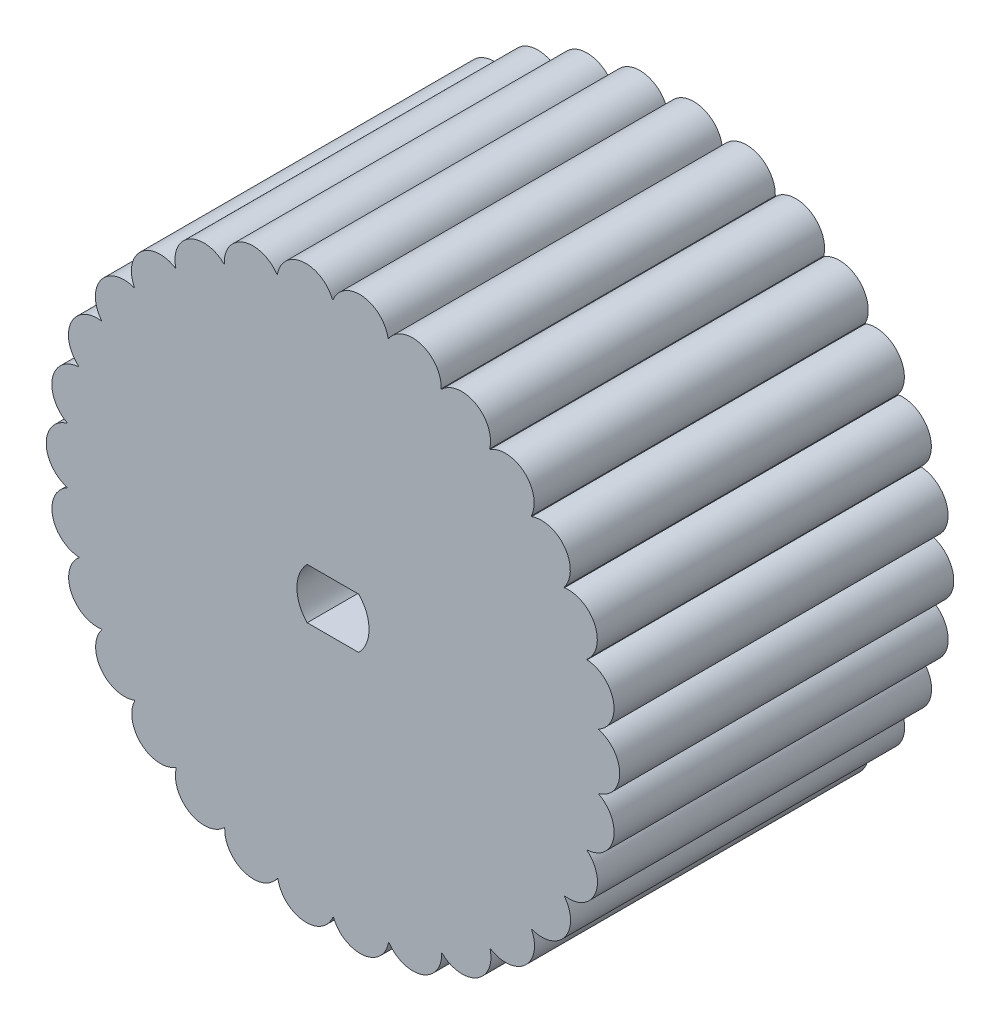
ISO-10303-21;
HEADER;
FILE_DESCRIPTION(('STEP AP214'),'2;1');
FILE_NAME('part.step','',(''),(''),'','','');
FILE_SCHEMA(('AUTOMOTIVE_DESIGN { 1 0 10303 214 1 1 1 1 }'));
ENDSEC;
DATA;
#1=APPLICATION_CONTEXT('core data for automotive mechanical design processes');
#2=APPLICATION_PROTOCOL_DEFINITION('international standard','automotive_design',2000,#1);
#3=PRODUCT_CONTEXT('',#1,'mechanical');
#4=PRODUCT('Part','Part','',(#3));
#5=PRODUCT_RELATED_PRODUCT_CATEGORY('part','',(#4));
#6=PRODUCT_DEFINITION_FORMATION('','',#4);
#7=PRODUCT_DEFINITION_CONTEXT('part definition',#1,'design');
#8=PRODUCT_DEFINITION('design','',#6,#7);
#9=PRODUCT_DEFINITION_SHAPE('','',#8);
#10=(LENGTH_UNIT() NAMED_UNIT(*) SI_UNIT(.MILLI.,.METRE.));
#11=(NAMED_UNIT(*) PLANE_ANGLE_UNIT() SI_UNIT($,.RADIAN.));
#12=(NAMED_UNIT(*) SI_UNIT($,.STERADIAN.) SOLID_ANGLE_UNIT());
#13=UNCERTAINTY_MEASURE_WITH_UNIT(LENGTH_MEASURE(1.E-05),#10,'distance_accuracy_value','');
#14=(GEOMETRIC_REPRESENTATION_CONTEXT(3) GLOBAL_UNCERTAINTY_ASSIGNED_CONTEXT((#13)) GLOBAL_UNIT_ASSIGNED_CONTEXT((#10,
#11,#12)) REPRESENTATION_CONTEXT('',''));
#15=CARTESIAN_POINT('',(0.,0.,0.));
#16=DIRECTION('',(0.,0.,1.));
#17=DIRECTION('',(1.,0.,0.));
#18=AXIS2_PLACEMENT_3D('',#15,#16,#17);
#19=CARTESIAN_POINT('',(0.999895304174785,9.60000486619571,25.));
#20=DIRECTION('',(0.,0.,1.));
#21=DIRECTION('',(1.,0.,0.));
#22=AXIS2_PLACEMENT_3D('',#19,#20,#21);
#23=PLANE('',#22);
#24=CARTESIAN_POINT('',(0.,0.,25.));
#25=DIRECTION('',(0.,0.,1.));
#26=DIRECTION('',(1.,0.,0.));
#27=AXIS2_PLACEMENT_3D('',#24,#25,#26);
#28=CIRCLE('',#27,20.);
#29=CARTESIAN_POINT('',(4.15823381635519,19.5629520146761,25.));
#30=VERTEX_POINT('',#29);
#31=CARTESIAN_POINT('',(4.12151641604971,19.570720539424,25.));
#32=VERTEX_POINT('',#31);
#33=EDGE_CURVE('E474',#30,#32,#28,.T.);
#34=ORIENTED_EDGE('',*,*,#33,.T.);
#35=CARTESIAN_POINT('',(1.99979060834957,19.2000097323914,25.));
#36=DIRECTION('',(0.,0.,1.));
#37=DIRECTION('',(-1.,0.,0.));
#38=AXIS2_PLACEMENT_3D('',#35,#36,#37);
#39=CIRCLE('',#38,2.15386789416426);
#40=CARTESIAN_POINT('',(0.,20.,25.));
#41=VERTEX_POINT('',#40);
#42=EDGE_CURVE('E477',#32,#41,#39,.T.);
#43=ORIENTED_EDGE('',*,*,#42,.T.);
#44=CARTESIAN_POINT('',(0.,0.,25.));
#45=DIRECTION('',(0.,0.,1.));
#46=DIRECTION('',(1.,0.,0.));
#47=AXIS2_PLACEMENT_3D('',#44,#45,#46);
#48=CIRCLE('',#47,20.);
#49=CARTESIAN_POINT('',(-0.0375302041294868,19.9999647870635,25.));
#50=VERTEX_POINT('',#49);
#51=EDGE_CURVE('E480',#41,#50,#48,.T.);
#52=ORIENTED_EDGE('',*,*,#51,.T.);
#53=CARTESIAN_POINT('',(-2.03581610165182,19.1962233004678,25.));
#54=DIRECTION('',(0.,0.,1.));
#55=DIRECTION('',(-1.,0.,0.));
#56=AXIS2_PLACEMENT_3D('',#53,#54,#55);
#57=CIRCLE('',#56,2.15386789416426);
#58=CARTESIAN_POINT('',(-4.1582338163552,19.5629520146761,25.));
#59=VERTEX_POINT('',#58);
#60=EDGE_CURVE('E482',#50,#59,#57,.T.);
#61=ORIENTED_EDGE('',*,*,#60,.T.);
#62=CARTESIAN_POINT('',(0.,0.,25.));
#63=DIRECTION('',(0.,0.,1.));
#64=DIRECTION('',(1.,0.,0.));
#65=AXIS2_PLACEMENT_3D('',#62,#63,#64);
#66=CIRCLE('',#65,20.);
#67=CARTESIAN_POINT('',(-4.19493657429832,19.5551146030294,25.));
#68=VERTEX_POINT('',#67);
#69=EDGE_CURVE('E484',#59,#68,#66,.T.);
#70=ORIENTED_EDGE('',*,*,#69,.T.);
#71=CARTESIAN_POINT('',(-5.98244787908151,18.3534697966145,25.));
#72=DIRECTION('',(0.,0.,1.));
#73=DIRECTION('',(-1.,0.,0.));
#74=AXIS2_PLACEMENT_3D('',#71,#72,#73);
#75=CIRCLE('',#74,2.15386789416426);
#76=CARTESIAN_POINT('',(-8.13473286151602,18.270909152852,25.));
#77=VERTEX_POINT('',#76);
#78=EDGE_CURVE('E486',#68,#77,#75,.T.);
#79=ORIENTED_EDGE('',*,*,#78,.T.);
#80=CARTESIAN_POINT('',(0.,0.,25.));
#81=DIRECTION('',(0.,0.,1.));
#82=DIRECTION('',(1.,0.,0.));
#83=AXIS2_PLACEMENT_3D('',#80,#81,#82);
#84=CIRCLE('',#83,20.);
#85=CARTESIAN_POINT('',(-8.16900408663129,18.2556120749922,25.));
#86=VERTEX_POINT('',#85);
#87=EDGE_CURVE('E488',#77,#86,#84,.T.);
#88=ORIENTED_EDGE('',*,*,#87,.T.);
#89=CARTESIAN_POINT('',(-9.66761797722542,16.7085815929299,25.));
#90=DIRECTION('',(0.,0.,1.));
#91=DIRECTION('',(-1.,0.,0.));
#92=AXIS2_PLACEMENT_3D('',#89,#90,#91);
#93=CIRCLE('',#92,2.15386789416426);
#94=CARTESIAN_POINT('',(-11.7557050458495,16.1803398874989,25.));
#95=VERTEX_POINT('',#94);
#96=EDGE_CURVE('E490',#86,#95,#93,.T.);
#97=ORIENTED_EDGE('',*,*,#96,.T.);
#98=CARTESIAN_POINT('',(0.,0.,25.));
#99=DIRECTION('',(0.,0.,1.));
#100=DIRECTION('',(1.,0.,0.));
#101=AXIS2_PLACEMENT_3D('',#98,#99,#100);
#102=CIRCLE('',#101,20.);
#103=CARTESIAN_POINT('',(-11.7860469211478,16.158251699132,25.));
#104=VERTEX_POINT('',#103);
#105=EDGE_CURVE('E492',#95,#104,#102,.T.);
#106=ORIENTED_EDGE('',*,*,#105,.T.);
#107=CARTESIAN_POINT('',(-12.9302667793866,14.3334481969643,25.));
#108=DIRECTION('',(0.,0.,1.));
#109=DIRECTION('',(-1.,0.,0.));
#110=AXIS2_PLACEMENT_3D('',#107,#108,#109);
#111=CIRCLE('',#110,2.15386789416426);
#112=CARTESIAN_POINT('',(-14.8628965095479,13.3826121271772,25.));
#113=VERTEX_POINT('',#112);
#114=EDGE_CURVE('E494',#104,#113,#111,.T.);
#115=ORIENTED_EDGE('',*,*,#114,.T.);
#116=CARTESIAN_POINT('',(0.,0.,25.));
#117=DIRECTION('',(0.,0.,1.));
#118=DIRECTION('',(1.,0.,0.));
#119=AXIS2_PLACEMENT_3D('',#116,#117,#118);
#120=CIRCLE('',#119,20.);
#121=CARTESIAN_POINT('',(-14.8879829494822,13.3546981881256,25.));
#122=VERTEX_POINT('',#121);
#123=EDGE_CURVE('E496',#113,#122,#120,.T.);
#124=ORIENTED_EDGE('',*,*,#123,.T.);
#125=CARTESIAN_POINT('',(-15.6278008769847,11.331874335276,25.));
#126=DIRECTION('',(0.,0.,1.));
#127=DIRECTION('',(-1.,0.,0.));
#128=AXIS2_PLACEMENT_3D('',#125,#126,#127);
#129=CIRCLE('',#128,2.15386789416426);
#130=CARTESIAN_POINT('',(-17.3205080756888,9.99999999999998,25.));
#131=VERTEX_POINT('',#130);
#132=EDGE_CURVE('E498',#122,#131,#129,.T.);
#133=ORIENTED_EDGE('',*,*,#132,.T.);
#134=CARTESIAN_POINT('',(0.,0.,25.));
#135=DIRECTION('',(0.,0.,1.));
#136=DIRECTION('',(1.,0.,0.));
#137=AXIS2_PLACEMENT_3D('',#134,#135,#136);
#138=CIRCLE('',#137,20.);
#139=CARTESIAN_POINT('',(-17.3392426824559,9.96748028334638,25.));
#140=VERTEX_POINT('',#139);
#141=EDGE_CURVE('E500',#131,#140,#138,.T.);
#142=ORIENTED_EDGE('',*,*,#141,.T.);
#143=CARTESIAN_POINT('',(-17.6423250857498,7.83504318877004,25.));
#144=DIRECTION('',(0.,0.,1.));
#145=DIRECTION('',(-1.,0.,0.));
#146=AXIS2_PLACEMENT_3D('',#143,#144,#145);
#147=CIRCLE('',#146,2.15386789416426);
#148=CARTESIAN_POINT('',(-19.0211303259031,6.18033988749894,25.));
#149=VERTEX_POINT('',#148);
#150=EDGE_CURVE('E502',#140,#149,#147,.T.);
#151=ORIENTED_EDGE('',*,*,#150,.T.);
#152=CARTESIAN_POINT('',(0.,0.,25.));
#153=DIRECTION('',(0.,0.,1.));
#154=DIRECTION('',(1.,0.,0.));
#155=AXIS2_PLACEMENT_3D('',#152,#153,#154);
#156=CIRCLE('',#155,20.);
#157=CARTESIAN_POINT('',(-19.0326943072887,6.1446356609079,25.));
#158=VERTEX_POINT('',#157);
#159=EDGE_CURVE('E504',#149,#158,#156,.T.);
#160=ORIENTED_EDGE('',*,*,#159,.T.);
#161=CARTESIAN_POINT('',(-18.8857950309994,3.99578305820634,25.));
#162=DIRECTION('',(0.,0.,1.));
#163=DIRECTION('',(-1.,0.,0.));
#164=AXIS2_PLACEMENT_3D('',#161,#162,#163);
#165=CIRCLE('',#164,2.15386789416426);
#166=CARTESIAN_POINT('',(-19.8904379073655,2.09056926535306,25.));
#167=VERTEX_POINT('',#166);
#168=EDGE_CURVE('E506',#158,#167,#165,.T.);
#169=ORIENTED_EDGE('',*,*,#168,.T.);
#170=CARTESIAN_POINT('',(0.,0.,25.));
#171=DIRECTION('',(0.,0.,1.));
#172=DIRECTION('',(1.,0.,0.));
#173=AXIS2_PLACEMENT_3D('',#170,#171,#172);
#174=CIRCLE('',#173,20.);
#175=CARTESIAN_POINT('',(-19.8943258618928,2.0532409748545,25.));
#176=VERTEX_POINT('',#175);
#177=EDGE_CURVE('E508',#167,#176,#174,.T.);
#178=ORIENTED_EDGE('',*,*,#177,.T.);
#179=CARTESIAN_POINT('',(-19.3038651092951,-0.0181119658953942,25.));
#180=DIRECTION('',(0.,0.,1.));
#181=DIRECTION('',(-1.,0.,0.));
#182=AXIS2_PLACEMENT_3D('',#179,#180,#181);
#183=CIRCLE('',#182,2.15386789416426);
#184=CARTESIAN_POINT('',(-19.8904379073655,-2.09056926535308,25.));
#185=VERTEX_POINT('',#184);
#186=EDGE_CURVE('E510',#176,#185,#183,.T.);
#187=ORIENTED_EDGE('',*,*,#186,.T.);
#188=CARTESIAN_POINT('',(0.,0.,25.));
#189=DIRECTION('',(0.,0.,1.));
#190=DIRECTION('',(1.,0.,0.));
#191=AXIS2_PLACEMENT_3D('',#188,#189,#190);
#192=CIRCLE('',#191,20.);
#193=CARTESIAN_POINT('',(-19.8864799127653,-2.12789019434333,25.));
#194=VERTEX_POINT('',#193);
#195=EDGE_CURVE('E512',#185,#194,#192,.T.);
#196=ORIENTED_EDGE('',*,*,#195,.T.);
#197=CARTESIAN_POINT('',(-18.8782636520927,-4.03121541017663,25.));
#198=DIRECTION('',(0.,0.,1.));
#199=DIRECTION('',(-1.,0.,0.));
#200=AXIS2_PLACEMENT_3D('',#197,#198,#199);
#201=CIRCLE('',#200,2.15386789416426);
#202=CARTESIAN_POINT('',(-19.0211303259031,-6.18033988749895,25.));
#203=VERTEX_POINT('',#202);
#204=EDGE_CURVE('E514',#194,#203,#201,.T.);
#205=ORIENTED_EDGE('',*,*,#204,.T.);
#206=CARTESIAN_POINT('',(0.,0.,25.));
#207=DIRECTION('',(0.,0.,1.));
#208=DIRECTION('',(1.,0.,0.));
#209=AXIS2_PLACEMENT_3D('',#206,#207,#208);
#210=CIRCLE('',#209,20.);
#211=CARTESIAN_POINT('',(-19.0094993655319,-6.21602235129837,25.));
#212=VERTEX_POINT('',#211);
#213=EDGE_CURVE('E516',#203,#212,#210,.T.);
#214=ORIENTED_EDGE('',*,*,#213,.T.);
#215=CARTESIAN_POINT('',(-17.6275914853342,-7.86813539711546,25.));
#216=DIRECTION('',(0.,0.,1.));
#217=DIRECTION('',(-1.,0.,0.));
#218=AXIS2_PLACEMENT_3D('',#215,#216,#217);
#219=CIRCLE('',#218,2.15386789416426);
#220=CARTESIAN_POINT('',(-17.3205080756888,-10.,25.));
#221=VERTEX_POINT('',#220);
#222=EDGE_CURVE('E518',#212,#221,#219,.T.);
#223=ORIENTED_EDGE('',*,*,#222,.T.);
#224=CARTESIAN_POINT('',(0.,0.,25.));
#225=DIRECTION('',(0.,0.,1.));
#226=DIRECTION('',(1.,0.,0.));
#227=AXIS2_PLACEMENT_3D('',#224,#225,#226);
#228=CIRCLE('',#227,20.);
#229=CARTESIAN_POINT('',(-17.3017124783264,-10.0324845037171,25.));
#230=VERTEX_POINT('',#229);
#231=EDGE_CURVE('E520',#221,#230,#228,.T.);
#232=ORIENTED_EDGE('',*,*,#231,.T.);
#233=CARTESIAN_POINT('',(-15.606508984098,-11.3611801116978,25.));
#234=DIRECTION('',(0.,0.,1.));
#235=DIRECTION('',(-1.,0.,0.));
#236=AXIS2_PLACEMENT_3D('',#233,#234,#235);
#237=CIRCLE('',#236,2.15386789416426);
#238=CARTESIAN_POINT('',(-14.8628965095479,-13.3826121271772,25.));
#239=VERTEX_POINT('',#238);
#240=EDGE_CURVE('E522',#230,#239,#237,.T.);
#241=ORIENTED_EDGE('',*,*,#240,.T.);
#242=CARTESIAN_POINT('',(0.,0.,25.));
#243=DIRECTION('',(0.,0.,1.));
#244=DIRECTION('',(1.,0.,0.));
#245=AXIS2_PLACEMENT_3D('',#242,#243,#244);
#246=CIRCLE('',#245,20.);
#247=CARTESIAN_POINT('',(-14.8377577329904,-13.4104789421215,25.));
#248=VERTEX_POINT('',#247);
#249=EDGE_CURVE('E524',#239,#248,#246,.T.);
#250=ORIENTED_EDGE('',*,*,#249,.T.);
#251=CARTESIAN_POINT('',(-12.9033471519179,-14.3576867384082,25.));
#252=DIRECTION('',(0.,0.,1.));
#253=DIRECTION('',(-1.,0.,0.));
#254=AXIS2_PLACEMENT_3D('',#251,#252,#253);
#255=CIRCLE('',#254,2.15386789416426);
#256=CARTESIAN_POINT('',(-11.7557050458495,-16.1803398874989,25.));
#257=VERTEX_POINT('',#256);
#258=EDGE_CURVE('E526',#248,#257,#255,.T.);
#259=ORIENTED_EDGE('',*,*,#258,.T.);
#260=CARTESIAN_POINT('',(0.,0.,25.));
#261=DIRECTION('',(0.,0.,1.));
#262=DIRECTION('',(1.,0.,0.));
#263=AXIS2_PLACEMENT_3D('',#260,#261,#262);
#264=CIRCLE('',#263,20.);
#265=CARTESIAN_POINT('',(-11.7253217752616,-16.2023711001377,25.));
#266=VERTEX_POINT('',#265);
#267=EDGE_CURVE('E528',#257,#266,#264,.T.);
#268=ORIENTED_EDGE('',*,*,#267,.T.);
#269=CARTESIAN_POINT('',(-9.63624713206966,-16.7266935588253,25.));
#270=DIRECTION('',(0.,0.,1.));
#271=DIRECTION('',(-1.,0.,0.));
#272=AXIS2_PLACEMENT_3D('',#269,#270,#271);
#273=CIRCLE('',#272,2.15386789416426);
#274=CARTESIAN_POINT('',(-8.134732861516,-18.270909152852,25.));
#275=VERTEX_POINT('',#274);
#276=EDGE_CURVE('E530',#266,#275,#273,.T.);
#277=ORIENTED_EDGE('',*,*,#276,.T.);
#278=CARTESIAN_POINT('',(0.,0.,25.));
#279=DIRECTION('',(0.,0.,1.));
#280=DIRECTION('',(1.,0.,0.));
#281=AXIS2_PLACEMENT_3D('',#278,#279,#280);
#282=CIRCLE('',#281,20.);
#283=CARTESIAN_POINT('',(-8.10043299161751,-18.2861418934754,25.));
#284=VERTEX_POINT('',#283);
#285=EDGE_CURVE('E532',#275,#284,#282,.T.);
#286=ORIENTED_EDGE('',*,*,#285,.T.);
#287=CARTESIAN_POINT('',(-5.94799687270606,-18.364663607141,25.));
#288=DIRECTION('',(0.,0.,1.));
#289=DIRECTION('',(-1.,0.,0.));
#290=AXIS2_PLACEMENT_3D('',#287,#288,#289);
#291=CIRCLE('',#290,2.15386789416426);
#292=CARTESIAN_POINT('',(-4.15823381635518,-19.5629520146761,25.));
#293=VERTEX_POINT('',#292);
#294=EDGE_CURVE('E534',#284,#293,#291,.T.);
#295=ORIENTED_EDGE('',*,*,#294,.T.);
#296=CARTESIAN_POINT('',(0.,0.,25.));
#297=DIRECTION('',(0.,0.,1.));
#298=DIRECTION('',(1.,0.,0.));
#299=AXIS2_PLACEMENT_3D('',#296,#297,#298);
#300=CIRCLE('',#299,20.);
#301=CARTESIAN_POINT('',(-4.12151641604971,-19.570720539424,25.));
#302=VERTEX_POINT('',#301);
#303=EDGE_CURVE('E536',#293,#302,#300,.T.);
#304=ORIENTED_EDGE('',*,*,#303,.T.);
#305=CARTESIAN_POINT('',(-1.99979060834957,-19.2000097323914,25.));
#306=DIRECTION('',(0.,0.,1.));
#307=DIRECTION('',(-1.,0.,0.));
#308=AXIS2_PLACEMENT_3D('',#305,#306,#307);
#309=CIRCLE('',#308,2.15386789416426);
#310=CARTESIAN_POINT('',(0.,-20.,25.));
#311=VERTEX_POINT('',#310);
#312=EDGE_CURVE('E538',#302,#311,#309,.T.);
#313=ORIENTED_EDGE('',*,*,#312,.T.);
#314=CARTESIAN_POINT('',(0.,0.,25.));
#315=DIRECTION('',(0.,0.,1.));
#316=DIRECTION('',(1.,0.,0.));
#317=AXIS2_PLACEMENT_3D('',#314,#315,#316);
#318=CIRCLE('',#317,20.);
#319=CARTESIAN_POINT('',(0.0375302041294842,-19.9999647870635,25.));
#320=VERTEX_POINT('',#319);
#321=EDGE_CURVE('E540',#311,#320,#318,.T.);
#322=ORIENTED_EDGE('',*,*,#321,.T.);
#323=CARTESIAN_POINT('',(2.03581610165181,-19.1962233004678,25.));
#324=DIRECTION('',(0.,0.,1.));
#325=DIRECTION('',(-1.,0.,0.));
#326=AXIS2_PLACEMENT_3D('',#323,#324,#325);
#327=CIRCLE('',#326,2.15386789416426);
#328=CARTESIAN_POINT('',(4.15823381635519,-19.5629520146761,25.));
#329=VERTEX_POINT('',#328);
#330=EDGE_CURVE('E542',#320,#329,#327,.T.);
#331=ORIENTED_EDGE('',*,*,#330,.T.);
#332=CARTESIAN_POINT('',(0.,0.,25.));
#333=DIRECTION('',(0.,0.,1.));
#334=DIRECTION('',(1.,0.,0.));
#335=AXIS2_PLACEMENT_3D('',#332,#333,#334);
#336=CIRCLE('',#335,20.);
#337=CARTESIAN_POINT('',(4.19493657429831,-19.5551146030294,25.));
#338=VERTEX_POINT('',#337);
#339=EDGE_CURVE('E544',#329,#338,#336,.T.);
#340=ORIENTED_EDGE('',*,*,#339,.T.);
#341=CARTESIAN_POINT('',(5.9824478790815,-18.3534697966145,25.));
#342=DIRECTION('',(0.,0.,1.));
#343=DIRECTION('',(-1.,0.,0.));
#344=AXIS2_PLACEMENT_3D('',#341,#342,#343);
#345=CIRCLE('',#344,2.15386789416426);
#346=CARTESIAN_POINT('',(8.13473286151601,-18.270909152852,25.));
#347=VERTEX_POINT('',#346);
#348=EDGE_CURVE('E546',#338,#347,#345,.T.);
#349=ORIENTED_EDGE('',*,*,#348,.T.);
#350=CARTESIAN_POINT('',(0.,0.,25.));
#351=DIRECTION('',(0.,0.,1.));
#352=DIRECTION('',(1.,0.,0.));
#353=AXIS2_PLACEMENT_3D('',#350,#351,#352);
#354=CIRCLE('',#353,20.);
#355=CARTESIAN_POINT('',(8.16900408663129,-18.2556120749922,25.));
#356=VERTEX_POINT('',#355);
#357=EDGE_CURVE('E548',#347,#356,#354,.T.);
#358=ORIENTED_EDGE('',*,*,#357,.T.);
#359=CARTESIAN_POINT('',(9.66761797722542,-16.7085815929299,25.));
#360=DIRECTION('',(0.,0.,1.));
#361=DIRECTION('',(-1.,0.,0.));
#362=AXIS2_PLACEMENT_3D('',#359,#360,#361);
#363=CIRCLE('',#362,2.15386789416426);
#364=CARTESIAN_POINT('',(11.7557050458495,-16.180339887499,25.));
#365=VERTEX_POINT('',#364);
#366=EDGE_CURVE('E550',#356,#365,#363,.T.);
#367=ORIENTED_EDGE('',*,*,#366,.T.);
#368=CARTESIAN_POINT('',(0.,0.,25.));
#369=DIRECTION('',(0.,0.,1.));
#370=DIRECTION('',(1.,0.,0.));
#371=AXIS2_PLACEMENT_3D('',#368,#369,#370);
#372=CIRCLE('',#371,20.);
#373=CARTESIAN_POINT('',(11.7860469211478,-16.158251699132,25.));
#374=VERTEX_POINT('',#373);
#375=EDGE_CURVE('E552',#365,#374,#372,.T.);
#376=ORIENTED_EDGE('',*,*,#375,.T.);
#377=CARTESIAN_POINT('',(12.9302667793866,-14.3334481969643,25.));
#378=DIRECTION('',(0.,0.,1.));
#379=DIRECTION('',(-1.,0.,0.));
#380=AXIS2_PLACEMENT_3D('',#377,#378,#379);
#381=CIRCLE('',#380,2.15386789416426);
#382=CARTESIAN_POINT('',(14.8628965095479,-13.3826121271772,25.));
#383=VERTEX_POINT('',#382);
#384=EDGE_CURVE('E554',#374,#383,#381,.T.);
#385=ORIENTED_EDGE('',*,*,#384,.T.);
#386=CARTESIAN_POINT('',(0.,0.,25.));
#387=DIRECTION('',(0.,0.,1.));
#388=DIRECTION('',(1.,0.,0.));
#389=AXIS2_PLACEMENT_3D('',#386,#387,#388);
#390=CIRCLE('',#389,20.);
#391=CARTESIAN_POINT('',(14.8879829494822,-13.3546981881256,25.));
#392=VERTEX_POINT('',#391);
#393=EDGE_CURVE('E556',#383,#392,#390,.T.);
#394=ORIENTED_EDGE('',*,*,#393,.T.);
#395=CARTESIAN_POINT('',(15.6278008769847,-11.331874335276,25.));
#396=DIRECTION('',(0.,0.,1.));
#397=DIRECTION('',(-1.,0.,0.));
#398=AXIS2_PLACEMENT_3D('',#395,#396,#397);
#399=CIRCLE('',#398,2.15386789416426);
#400=CARTESIAN_POINT('',(17.3205080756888,-9.99999999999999,25.));
#401=VERTEX_POINT('',#400);
#402=EDGE_CURVE('E558',#392,#401,#399,.T.);
#403=ORIENTED_EDGE('',*,*,#402,.T.);
#404=CARTESIAN_POINT('',(0.,0.,25.));
#405=DIRECTION('',(0.,0.,1.));
#406=DIRECTION('',(1.,0.,0.));
#407=AXIS2_PLACEMENT_3D('',#404,#405,#406);
#408=CIRCLE('',#407,20.);
#409=CARTESIAN_POINT('',(17.3392426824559,-9.96748028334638,25.));
#410=VERTEX_POINT('',#409);
#411=EDGE_CURVE('E560',#401,#410,#408,.T.);
#412=ORIENTED_EDGE('',*,*,#411,.T.);
#413=CARTESIAN_POINT('',(17.6423250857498,-7.83504318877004,25.));
#414=DIRECTION('',(0.,0.,1.));
#415=DIRECTION('',(-1.,0.,0.));
#416=AXIS2_PLACEMENT_3D('',#413,#414,#415);
#417=CIRCLE('',#416,2.15386789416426);
#418=CARTESIAN_POINT('',(19.0211303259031,-6.18033988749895,25.));
#419=VERTEX_POINT('',#418);
#420=EDGE_CURVE('E562',#410,#419,#417,.T.);
#421=ORIENTED_EDGE('',*,*,#420,.T.);
#422=CARTESIAN_POINT('',(0.,0.,25.));
#423=DIRECTION('',(0.,0.,1.));
#424=DIRECTION('',(1.,0.,0.));
#425=AXIS2_PLACEMENT_3D('',#422,#423,#424);
#426=CIRCLE('',#425,20.);
#427=CARTESIAN_POINT('',(19.0326943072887,-6.14463566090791,25.));
#428=VERTEX_POINT('',#427);
#429=EDGE_CURVE('E564',#419,#428,#426,.T.);
#430=ORIENTED_EDGE('',*,*,#429,.T.);
#431=CARTESIAN_POINT('',(18.8857950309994,-3.99578305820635,25.));
#432=DIRECTION('',(0.,0.,1.));
#433=DIRECTION('',(-1.,0.,0.));
#434=AXIS2_PLACEMENT_3D('',#431,#432,#433);
#435=CIRCLE('',#434,2.15386789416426);
#436=CARTESIAN_POINT('',(19.8904379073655,-2.09056926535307,25.));
#437=VERTEX_POINT('',#436);
#438=EDGE_CURVE('E566',#428,#437,#435,.T.);
#439=ORIENTED_EDGE('',*,*,#438,.T.);
#440=CARTESIAN_POINT('',(0.,0.,25.));
#441=DIRECTION('',(0.,0.,1.));
#442=DIRECTION('',(1.,0.,0.));
#443=AXIS2_PLACEMENT_3D('',#440,#441,#442);
#444=CIRCLE('',#443,20.);
#445=CARTESIAN_POINT('',(19.8943258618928,-2.05324097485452,25.));
#446=VERTEX_POINT('',#445);
#447=EDGE_CURVE('E568',#437,#446,#444,.T.);
#448=ORIENTED_EDGE('',*,*,#447,.T.);
#449=CARTESIAN_POINT('',(19.3038651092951,0.0181119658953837,25.));
#450=DIRECTION('',(0.,0.,1.));
#451=DIRECTION('',(-1.,0.,0.));
#452=AXIS2_PLACEMENT_3D('',#449,#450,#451);
#453=CIRCLE('',#452,2.15386789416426);
#454=CARTESIAN_POINT('',(19.8904379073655,2.09056926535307,25.));
#455=VERTEX_POINT('',#454);
#456=EDGE_CURVE('E570',#446,#455,#453,.T.);
#457=ORIENTED_EDGE('',*,*,#456,.T.);
#458=CARTESIAN_POINT('',(0.,0.,25.));
#459=DIRECTION('',(0.,0.,1.));
#460=DIRECTION('',(1.,0.,0.));
#461=AXIS2_PLACEMENT_3D('',#458,#459,#460);
#462=CIRCLE('',#461,20.);
#463=CARTESIAN_POINT('',(19.8864799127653,2.12789019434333,25.));
#464=VERTEX_POINT('',#463);
#465=EDGE_CURVE('E572',#455,#464,#462,.T.);
#466=ORIENTED_EDGE('',*,*,#465,.T.);
#467=CARTESIAN_POINT('',(18.8782636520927,4.03121541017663,25.));
#468=DIRECTION('',(0.,0.,1.));
#469=DIRECTION('',(-1.,0.,0.));
#470=AXIS2_PLACEMENT_3D('',#467,#468,#469);
#471=CIRCLE('',#470,2.15386789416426);
#472=CARTESIAN_POINT('',(19.0211303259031,6.18033988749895,25.));
#473=VERTEX_POINT('',#472);
#474=EDGE_CURVE('E574',#464,#473,#471,.T.);
#475=ORIENTED_EDGE('',*,*,#474,.T.);
#476=CARTESIAN_POINT('',(0.,0.,25.));
#477=DIRECTION('',(0.,0.,1.));
#478=DIRECTION('',(1.,0.,0.));
#479=AXIS2_PLACEMENT_3D('',#476,#477,#478);
#480=CIRCLE('',#479,20.);
#481=CARTESIAN_POINT('',(19.0094993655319,6.21602235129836,25.));
#482=VERTEX_POINT('',#481);
#483=EDGE_CURVE('E576',#473,#482,#480,.T.);
#484=ORIENTED_EDGE('',*,*,#483,.T.);
#485=CARTESIAN_POINT('',(17.6275914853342,7.86813539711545,25.));
#486=DIRECTION('',(0.,0.,1.));
#487=DIRECTION('',(-1.,0.,0.));
#488=AXIS2_PLACEMENT_3D('',#485,#486,#487);
#489=CIRCLE('',#488,2.15386789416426);
#490=CARTESIAN_POINT('',(17.3205080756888,10.,25.));
#491=VERTEX_POINT('',#490);
#492=EDGE_CURVE('E578',#482,#491,#489,.T.);
#493=ORIENTED_EDGE('',*,*,#492,.T.);
#494=CARTESIAN_POINT('',(0.,0.,25.));
#495=DIRECTION('',(0.,0.,1.));
#496=DIRECTION('',(1.,0.,0.));
#497=AXIS2_PLACEMENT_3D('',#494,#495,#496);
#498=CIRCLE('',#497,20.);
#499=CARTESIAN_POINT('',(17.3017124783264,10.0324845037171,25.));
#500=VERTEX_POINT('',#499);
#501=EDGE_CURVE('E580',#491,#500,#498,.T.);
#502=ORIENTED_EDGE('',*,*,#501,.T.);
#503=CARTESIAN_POINT('',(15.606508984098,11.3611801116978,25.));
#504=DIRECTION('',(0.,0.,1.));
#505=DIRECTION('',(-1.,0.,0.));
#506=AXIS2_PLACEMENT_3D('',#503,#504,#505);
#507=CIRCLE('',#506,2.15386789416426);
#508=CARTESIAN_POINT('',(14.8628965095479,13.3826121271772,25.));
#509=VERTEX_POINT('',#508);
#510=EDGE_CURVE('E582',#500,#509,#507,.T.);
#511=ORIENTED_EDGE('',*,*,#510,.T.);
#512=CARTESIAN_POINT('',(0.,0.,25.));
#513=DIRECTION('',(0.,0.,1.));
#514=DIRECTION('',(1.,0.,0.));
#515=AXIS2_PLACEMENT_3D('',#512,#513,#514);
#516=CIRCLE('',#515,20.);
#517=CARTESIAN_POINT('',(14.8377577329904,13.4104789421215,25.));
#518=VERTEX_POINT('',#517);
#519=EDGE_CURVE('E584',#509,#518,#516,.T.);
#520=ORIENTED_EDGE('',*,*,#519,.T.);
#521=CARTESIAN_POINT('',(12.9033471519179,14.3576867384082,25.));
#522=DIRECTION('',(0.,0.,1.));
#523=DIRECTION('',(-1.,0.,0.));
#524=AXIS2_PLACEMENT_3D('',#521,#522,#523);
#525=CIRCLE('',#524,2.15386789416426);
#526=CARTESIAN_POINT('',(11.7557050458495,16.180339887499,25.));
#527=VERTEX_POINT('',#526);
#528=EDGE_CURVE('E586',#518,#527,#525,.T.);
#529=ORIENTED_EDGE('',*,*,#528,.T.);
#530=CARTESIAN_POINT('',(0.,0.,25.));
#531=DIRECTION('',(0.,0.,1.));
#532=DIRECTION('',(1.,0.,0.));
#533=AXIS2_PLACEMENT_3D('',#530,#531,#532);
#534=CIRCLE('',#533,20.);
#535=CARTESIAN_POINT('',(11.7253217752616,16.2023711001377,25.));
#536=VERTEX_POINT('',#535);
#537=EDGE_CURVE('E588',#527,#536,#534,.T.);
#538=ORIENTED_EDGE('',*,*,#537,.T.);
#539=CARTESIAN_POINT('',(9.63624713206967,16.7266935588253,25.));
#540=DIRECTION('',(0.,0.,1.));
#541=DIRECTION('',(-1.,0.,0.));
#542=AXIS2_PLACEMENT_3D('',#539,#540,#541);
#543=CIRCLE('',#542,2.15386789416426);
#544=CARTESIAN_POINT('',(8.13473286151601,18.270909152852,25.));
#545=VERTEX_POINT('',#544);
#546=EDGE_CURVE('E590',#536,#545,#543,.T.);
#547=ORIENTED_EDGE('',*,*,#546,.T.);
#548=CARTESIAN_POINT('',(0.,0.,25.));
#549=DIRECTION('',(0.,0.,1.));
#550=DIRECTION('',(1.,0.,0.));
#551=AXIS2_PLACEMENT_3D('',#548,#549,#550);
#552=CIRCLE('',#551,20.);
#553=CARTESIAN_POINT('',(8.10043299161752,18.2861418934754,25.));
#554=VERTEX_POINT('',#553);
#555=EDGE_CURVE('E592',#545,#554,#552,.T.);
#556=ORIENTED_EDGE('',*,*,#555,.T.);
#557=CARTESIAN_POINT('',(5.94799687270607,18.364663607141,25.));
#558=DIRECTION('',(0.,0.,1.));
#559=DIRECTION('',(-1.,0.,0.));
#560=AXIS2_PLACEMENT_3D('',#557,#558,#559);
#561=CIRCLE('',#560,2.15386789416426);
#562=EDGE_CURVE('E594',#554,#30,#561,.T.);
#563=ORIENTED_EDGE('',*,*,#562,.T.);
#564=EDGE_LOOP('',(#34,#43,#52,#61,#70,#79,#88,#97,#106,#115,#124,#133,#142,#151,#160,#169,#178,
#187,#196,#205,#214,#223,#232,#241,#250,#259,#268,#277,#286,#295,#304,#313,#322,#331,#340,#349,
#358,#367,#376,#385,#394,#403,#412,#421,#430,#439,#448,#457,#466,#475,#484,#493,#502,#511,#520,
#529,#538,#547,#556,#563));
#565=FACE_BOUND('',#564,.T.);
#566=DIRECTION('',(-1.,0.,0.));
#567=VECTOR('',#566,1.);
#568=CARTESIAN_POINT('',(-1.92818567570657,1.89,25.));
#569=LINE('',#568,#567);
#570=CARTESIAN_POINT('',(1.92818567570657,1.89,25.));
#571=VERTEX_POINT('',#570);
#572=CARTESIAN_POINT('',(-1.92818567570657,1.89,25.));
#573=VERTEX_POINT('',#572);
#574=EDGE_CURVE('E446',#571,#573,#569,.T.);
#575=ORIENTED_EDGE('',*,*,#574,.F.);
#576=CARTESIAN_POINT('',(0.,0.,25.));
#577=DIRECTION('',(0.,0.,1.));
#578=DIRECTION('',(1.,0.,0.));
#579=AXIS2_PLACEMENT_3D('',#576,#577,#578);
#580=CIRCLE('',#579,2.7);
#581=CARTESIAN_POINT('',(1.92818567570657,-1.89,25.));
#582=VERTEX_POINT('',#581);
#583=EDGE_CURVE('E438',#582,#571,#580,.T.);
#584=ORIENTED_EDGE('',*,*,#583,.F.);
#585=DIRECTION('',(1.,0.,0.));
#586=VECTOR('',#585,1.);
#587=CARTESIAN_POINT('',(-1.92818567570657,-1.89,25.));
#588=LINE('',#587,#586);
#589=CARTESIAN_POINT('',(-1.92818567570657,-1.89,25.));
#590=VERTEX_POINT('',#589);
#591=EDGE_CURVE('E460',#590,#582,#588,.T.);
#592=ORIENTED_EDGE('',*,*,#591,.F.);
#593=CARTESIAN_POINT('',(0.,0.,25.));
#594=DIRECTION('',(0.,0.,1.));
#595=DIRECTION('',(1.,0.,0.));
#596=AXIS2_PLACEMENT_3D('',#593,#594,#595);
#597=CIRCLE('',#596,2.7);
#598=EDGE_CURVE('E458',#573,#590,#597,.T.);
#599=ORIENTED_EDGE('',*,*,#598,.F.);
#600=EDGE_LOOP('',(#575,#584,#592,#599));
#601=FACE_BOUND('',#600,.T.);
#602=ADVANCED_FACE('F37',(#565,#601),#23,.T.);
#603=CARTESIAN_POINT('',(0.999895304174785,9.60000486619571,0.));
#604=DIRECTION('',(0.,0.,1.));
#605=DIRECTION('',(1.,0.,0.));
#606=AXIS2_PLACEMENT_3D('',#603,#604,#605);
#607=PLANE('',#606);
#608=CARTESIAN_POINT('',(0.,0.,0.));
#609=DIRECTION('',(0.,0.,1.));
#610=DIRECTION('',(1.,0.,0.));
#611=AXIS2_PLACEMENT_3D('',#608,#609,#610);
#612=CIRCLE('',#611,20.);
#613=CARTESIAN_POINT('',(4.15823381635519,19.5629520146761,0.));
#614=VERTEX_POINT('',#613);
#615=CARTESIAN_POINT('',(4.12151641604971,19.570720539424,0.));
#616=VERTEX_POINT('',#615);
#617=EDGE_CURVE('E454',#614,#616,#612,.T.);
#618=ORIENTED_EDGE('',*,*,#617,.F.);
#619=CARTESIAN_POINT('',(5.94799687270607,18.364663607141,0.));
#620=DIRECTION('',(0.,0.,1.));
#621=DIRECTION('',(-1.,0.,0.));
#622=AXIS2_PLACEMENT_3D('',#619,#620,#621);
#623=CIRCLE('',#622,2.15386789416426);
#624=CARTESIAN_POINT('',(8.10043299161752,18.2861418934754,0.));
#625=VERTEX_POINT('',#624);
#626=EDGE_CURVE('E478',#625,#614,#623,.T.);
#627=ORIENTED_EDGE('',*,*,#626,.F.);
#628=CARTESIAN_POINT('',(0.,0.,0.));
#629=DIRECTION('',(0.,0.,1.));
#630=DIRECTION('',(1.,0.,0.));
#631=AXIS2_PLACEMENT_3D('',#628,#629,#630);
#632=CIRCLE('',#631,20.);
#633=CARTESIAN_POINT('',(8.13473286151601,18.270909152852,0.));
#634=VERTEX_POINT('',#633);
#635=EDGE_CURVE('E713',#634,#625,#632,.T.);
#636=ORIENTED_EDGE('',*,*,#635,.F.);
#637=CARTESIAN_POINT('',(9.63624713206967,16.7266935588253,0.));
#638=DIRECTION('',(0.,0.,1.));
#639=DIRECTION('',(-1.,0.,0.));
#640=AXIS2_PLACEMENT_3D('',#637,#638,#639);
#641=CIRCLE('',#640,2.15386789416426);
#642=CARTESIAN_POINT('',(11.7253217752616,16.2023711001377,0.));
#643=VERTEX_POINT('',#642);
#644=EDGE_CURVE('E711',#643,#634,#641,.T.);
#645=ORIENTED_EDGE('',*,*,#644,.F.);
#646=CARTESIAN_POINT('',(0.,0.,0.));
#647=DIRECTION('',(0.,0.,1.));
#648=DIRECTION('',(1.,0.,0.));
#649=AXIS2_PLACEMENT_3D('',#646,#647,#648);
#650=CIRCLE('',#649,20.);
#651=CARTESIAN_POINT('',(11.7557050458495,16.180339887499,0.));
#652=VERTEX_POINT('',#651);
#653=EDGE_CURVE('E709',#652,#643,#650,.T.);
#654=ORIENTED_EDGE('',*,*,#653,.F.);
#655=CARTESIAN_POINT('',(12.9033471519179,14.3576867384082,0.));
#656=DIRECTION('',(0.,0.,1.));
#657=DIRECTION('',(-1.,0.,0.));
#658=AXIS2_PLACEMENT_3D('',#655,#656,#657);
#659=CIRCLE('',#658,2.15386789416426);
#660=CARTESIAN_POINT('',(14.8377577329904,13.4104789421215,0.));
#661=VERTEX_POINT('',#660);
#662=EDGE_CURVE('E707',#661,#652,#659,.T.);
#663=ORIENTED_EDGE('',*,*,#662,.F.);
#664=CARTESIAN_POINT('',(0.,0.,0.));
#665=DIRECTION('',(0.,0.,1.));
#666=DIRECTION('',(1.,0.,0.));
#667=AXIS2_PLACEMENT_3D('',#664,#665,#666);
#668=CIRCLE('',#667,20.);
#669=CARTESIAN_POINT('',(14.8628965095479,13.3826121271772,0.));
#670=VERTEX_POINT('',#669);
#671=EDGE_CURVE('E705',#670,#661,#668,.T.);
#672=ORIENTED_EDGE('',*,*,#671,.F.);
#673=CARTESIAN_POINT('',(15.606508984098,11.3611801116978,0.));
#674=DIRECTION('',(0.,0.,1.));
#675=DIRECTION('',(-1.,0.,0.));
#676=AXIS2_PLACEMENT_3D('',#673,#674,#675);
#677=CIRCLE('',#676,2.15386789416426);
#678=CARTESIAN_POINT('',(17.3017124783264,10.0324845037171,0.));
#679=VERTEX_POINT('',#678);
#680=EDGE_CURVE('E703',#679,#670,#677,.T.);
#681=ORIENTED_EDGE('',*,*,#680,.F.);
#682=CARTESIAN_POINT('',(0.,0.,0.));
#683=DIRECTION('',(0.,0.,1.));
#684=DIRECTION('',(1.,0.,0.));
#685=AXIS2_PLACEMENT_3D('',#682,#683,#684);
#686=CIRCLE('',#685,20.);
#687=CARTESIAN_POINT('',(17.3205080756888,10.,0.));
#688=VERTEX_POINT('',#687);
#689=EDGE_CURVE('E701',#688,#679,#686,.T.);
#690=ORIENTED_EDGE('',*,*,#689,.F.);
#691=CARTESIAN_POINT('',(17.6275914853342,7.86813539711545,0.));
#692=DIRECTION('',(0.,0.,1.));
#693=DIRECTION('',(-1.,0.,0.));
#694=AXIS2_PLACEMENT_3D('',#691,#692,#693);
#695=CIRCLE('',#694,2.15386789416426);
#696=CARTESIAN_POINT('',(19.0094993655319,6.21602235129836,0.));
#697=VERTEX_POINT('',#696);
#698=EDGE_CURVE('E699',#697,#688,#695,.T.);
#699=ORIENTED_EDGE('',*,*,#698,.F.);
#700=CARTESIAN_POINT('',(0.,0.,0.));
#701=DIRECTION('',(0.,0.,1.));
#702=DIRECTION('',(1.,0.,0.));
#703=AXIS2_PLACEMENT_3D('',#700,#701,#702);
#704=CIRCLE('',#703,20.);
#705=CARTESIAN_POINT('',(19.0211303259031,6.18033988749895,0.));
#706=VERTEX_POINT('',#705);
#707=EDGE_CURVE('E697',#706,#697,#704,.T.);
#708=ORIENTED_EDGE('',*,*,#707,.F.);
#709=CARTESIAN_POINT('',(18.8782636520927,4.03121541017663,0.));
#710=DIRECTION('',(0.,0.,1.));
#711=DIRECTION('',(-1.,0.,0.));
#712=AXIS2_PLACEMENT_3D('',#709,#710,#711);
#713=CIRCLE('',#712,2.15386789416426);
#714=CARTESIAN_POINT('',(19.8864799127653,2.12789019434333,0.));
#715=VERTEX_POINT('',#714);
#716=EDGE_CURVE('E695',#715,#706,#713,.T.);
#717=ORIENTED_EDGE('',*,*,#716,.F.);
#718=CARTESIAN_POINT('',(0.,0.,0.));
#719=DIRECTION('',(0.,0.,1.));
#720=DIRECTION('',(1.,0.,0.));
#721=AXIS2_PLACEMENT_3D('',#718,#719,#720);
#722=CIRCLE('',#721,20.);
#723=CARTESIAN_POINT('',(19.8904379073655,2.09056926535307,0.));
#724=VERTEX_POINT('',#723);
#725=EDGE_CURVE('E693',#724,#715,#722,.T.);
#726=ORIENTED_EDGE('',*,*,#725,.F.);
#727=CARTESIAN_POINT('',(19.3038651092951,0.0181119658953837,0.));
#728=DIRECTION('',(0.,0.,1.));
#729=DIRECTION('',(-1.,0.,0.));
#730=AXIS2_PLACEMENT_3D('',#727,#728,#729);
#731=CIRCLE('',#730,2.15386789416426);
#732=CARTESIAN_POINT('',(19.8943258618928,-2.05324097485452,0.));
#733=VERTEX_POINT('',#732);
#734=EDGE_CURVE('E691',#733,#724,#731,.T.);
#735=ORIENTED_EDGE('',*,*,#734,.F.);
#736=CARTESIAN_POINT('',(0.,0.,0.));
#737=DIRECTION('',(0.,0.,1.));
#738=DIRECTION('',(1.,0.,0.));
#739=AXIS2_PLACEMENT_3D('',#736,#737,#738);
#740=CIRCLE('',#739,20.);
#741=CARTESIAN_POINT('',(19.8904379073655,-2.09056926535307,0.));
#742=VERTEX_POINT('',#741);
#743=EDGE_CURVE('E689',#742,#733,#740,.T.);
#744=ORIENTED_EDGE('',*,*,#743,.F.);
#745=CARTESIAN_POINT('',(18.8857950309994,-3.99578305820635,0.));
#746=DIRECTION('',(0.,0.,1.));
#747=DIRECTION('',(-1.,0.,0.));
#748=AXIS2_PLACEMENT_3D('',#745,#746,#747);
#749=CIRCLE('',#748,2.15386789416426);
#750=CARTESIAN_POINT('',(19.0326943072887,-6.14463566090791,0.));
#751=VERTEX_POINT('',#750);
#752=EDGE_CURVE('E687',#751,#742,#749,.T.);
#753=ORIENTED_EDGE('',*,*,#752,.F.);
#754=CARTESIAN_POINT('',(0.,0.,0.));
#755=DIRECTION('',(0.,0.,1.));
#756=DIRECTION('',(1.,0.,0.));
#757=AXIS2_PLACEMENT_3D('',#754,#755,#756);
#758=CIRCLE('',#757,20.);
#759=CARTESIAN_POINT('',(19.0211303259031,-6.18033988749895,0.));
#760=VERTEX_POINT('',#759);
#761=EDGE_CURVE('E685',#760,#751,#758,.T.);
#762=ORIENTED_EDGE('',*,*,#761,.F.);
#763=CARTESIAN_POINT('',(17.6423250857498,-7.83504318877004,0.));
#764=DIRECTION('',(0.,0.,1.));
#765=DIRECTION('',(-1.,0.,0.));
#766=AXIS2_PLACEMENT_3D('',#763,#764,#765);
#767=CIRCLE('',#766,2.15386789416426);
#768=CARTESIAN_POINT('',(17.3392426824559,-9.96748028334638,0.));
#769=VERTEX_POINT('',#768);
#770=EDGE_CURVE('E683',#769,#760,#767,.T.);
#771=ORIENTED_EDGE('',*,*,#770,.F.);
#772=CARTESIAN_POINT('',(0.,0.,0.));
#773=DIRECTION('',(0.,0.,1.));
#774=DIRECTION('',(1.,0.,0.));
#775=AXIS2_PLACEMENT_3D('',#772,#773,#774);
#776=CIRCLE('',#775,20.);
#777=CARTESIAN_POINT('',(17.3205080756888,-9.99999999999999,0.));
#778=VERTEX_POINT('',#777);
#779=EDGE_CURVE('E681',#778,#769,#776,.T.);
#780=ORIENTED_EDGE('',*,*,#779,.F.);
#781=CARTESIAN_POINT('',(15.6278008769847,-11.331874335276,0.));
#782=DIRECTION('',(0.,0.,1.));
#783=DIRECTION('',(-1.,0.,0.));
#784=AXIS2_PLACEMENT_3D('',#781,#782,#783);
#785=CIRCLE('',#784,2.15386789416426);
#786=CARTESIAN_POINT('',(14.8879829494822,-13.3546981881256,0.));
#787=VERTEX_POINT('',#786);
#788=EDGE_CURVE('E679',#787,#778,#785,.T.);
#789=ORIENTED_EDGE('',*,*,#788,.F.);
#790=CARTESIAN_POINT('',(0.,0.,0.));
#791=DIRECTION('',(0.,0.,1.));
#792=DIRECTION('',(1.,0.,0.));
#793=AXIS2_PLACEMENT_3D('',#790,#791,#792);
#794=CIRCLE('',#793,20.);
#795=CARTESIAN_POINT('',(14.8628965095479,-13.3826121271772,0.));
#796=VERTEX_POINT('',#795);
#797=EDGE_CURVE('E677',#796,#787,#794,.T.);
#798=ORIENTED_EDGE('',*,*,#797,.F.);
#799=CARTESIAN_POINT('',(12.9302667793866,-14.3334481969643,0.));
#800=DIRECTION('',(0.,0.,1.));
#801=DIRECTION('',(-1.,0.,0.));
#802=AXIS2_PLACEMENT_3D('',#799,#800,#801);
#803=CIRCLE('',#802,2.15386789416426);
#804=CARTESIAN_POINT('',(11.7860469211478,-16.158251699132,0.));
#805=VERTEX_POINT('',#804);
#806=EDGE_CURVE('E675',#805,#796,#803,.T.);
#807=ORIENTED_EDGE('',*,*,#806,.F.);
#808=CARTESIAN_POINT('',(0.,0.,0.));
#809=DIRECTION('',(0.,0.,1.));
#810=DIRECTION('',(1.,0.,0.));
#811=AXIS2_PLACEMENT_3D('',#808,#809,#810);
#812=CIRCLE('',#811,20.);
#813=CARTESIAN_POINT('',(11.7557050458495,-16.180339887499,0.));
#814=VERTEX_POINT('',#813);
#815=EDGE_CURVE('E673',#814,#805,#812,.T.);
#816=ORIENTED_EDGE('',*,*,#815,.F.);
#817=CARTESIAN_POINT('',(9.66761797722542,-16.7085815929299,0.));
#818=DIRECTION('',(0.,0.,1.));
#819=DIRECTION('',(-1.,0.,0.));
#820=AXIS2_PLACEMENT_3D('',#817,#818,#819);
#821=CIRCLE('',#820,2.15386789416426);
#822=CARTESIAN_POINT('',(8.16900408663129,-18.2556120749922,0.));
#823=VERTEX_POINT('',#822);
#824=EDGE_CURVE('E671',#823,#814,#821,.T.);
#825=ORIENTED_EDGE('',*,*,#824,.F.);
#826=CARTESIAN_POINT('',(0.,0.,0.));
#827=DIRECTION('',(0.,0.,1.));
#828=DIRECTION('',(1.,0.,0.));
#829=AXIS2_PLACEMENT_3D('',#826,#827,#828);
#830=CIRCLE('',#829,20.);
#831=CARTESIAN_POINT('',(8.13473286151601,-18.270909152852,0.));
#832=VERTEX_POINT('',#831);
#833=EDGE_CURVE('E669',#832,#823,#830,.T.);
#834=ORIENTED_EDGE('',*,*,#833,.F.);
#835=CARTESIAN_POINT('',(5.9824478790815,-18.3534697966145,0.));
#836=DIRECTION('',(0.,0.,1.));
#837=DIRECTION('',(-1.,0.,0.));
#838=AXIS2_PLACEMENT_3D('',#835,#836,#837);
#839=CIRCLE('',#838,2.15386789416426);
#840=CARTESIAN_POINT('',(4.19493657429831,-19.5551146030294,0.));
#841=VERTEX_POINT('',#840);
#842=EDGE_CURVE('E667',#841,#832,#839,.T.);
#843=ORIENTED_EDGE('',*,*,#842,.F.);
#844=CARTESIAN_POINT('',(0.,0.,0.));
#845=DIRECTION('',(0.,0.,1.));
#846=DIRECTION('',(1.,0.,0.));
#847=AXIS2_PLACEMENT_3D('',#844,#845,#846);
#848=CIRCLE('',#847,20.);
#849=CARTESIAN_POINT('',(4.15823381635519,-19.5629520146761,0.));
#850=VERTEX_POINT('',#849);
#851=EDGE_CURVE('E665',#850,#841,#848,.T.);
#852=ORIENTED_EDGE('',*,*,#851,.F.);
#853=CARTESIAN_POINT('',(2.03581610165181,-19.1962233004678,0.));
#854=DIRECTION('',(0.,0.,1.));
#855=DIRECTION('',(-1.,0.,0.));
#856=AXIS2_PLACEMENT_3D('',#853,#854,#855);
#857=CIRCLE('',#856,2.15386789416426);
#858=CARTESIAN_POINT('',(0.0375302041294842,-19.9999647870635,0.));
#859=VERTEX_POINT('',#858);
#860=EDGE_CURVE('E663',#859,#850,#857,.T.);
#861=ORIENTED_EDGE('',*,*,#860,.F.);
#862=CARTESIAN_POINT('',(0.,0.,0.));
#863=DIRECTION('',(0.,0.,1.));
#864=DIRECTION('',(1.,0.,0.));
#865=AXIS2_PLACEMENT_3D('',#862,#863,#864);
#866=CIRCLE('',#865,20.);
#867=CARTESIAN_POINT('',(0.,-20.,0.));
#868=VERTEX_POINT('',#867);
#869=EDGE_CURVE('E661',#868,#859,#866,.T.);
#870=ORIENTED_EDGE('',*,*,#869,.F.);
#871=CARTESIAN_POINT('',(-1.99979060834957,-19.2000097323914,0.));
#872=DIRECTION('',(0.,0.,1.));
#873=DIRECTION('',(-1.,0.,0.));
#874=AXIS2_PLACEMENT_3D('',#871,#872,#873);
#875=CIRCLE('',#874,2.15386789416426);
#876=CARTESIAN_POINT('',(-4.12151641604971,-19.570720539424,0.));
#877=VERTEX_POINT('',#876);
#878=EDGE_CURVE('E659',#877,#868,#875,.T.);
#879=ORIENTED_EDGE('',*,*,#878,.F.);
#880=CARTESIAN_POINT('',(0.,0.,0.));
#881=DIRECTION('',(0.,0.,1.));
#882=DIRECTION('',(1.,0.,0.));
#883=AXIS2_PLACEMENT_3D('',#880,#881,#882);
#884=CIRCLE('',#883,20.);
#885=CARTESIAN_POINT('',(-4.15823381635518,-19.5629520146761,0.));
#886=VERTEX_POINT('',#885);
#887=EDGE_CURVE('E657',#886,#877,#884,.T.);
#888=ORIENTED_EDGE('',*,*,#887,.F.);
#889=CARTESIAN_POINT('',(-5.94799687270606,-18.364663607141,0.));
#890=DIRECTION('',(0.,0.,1.));
#891=DIRECTION('',(-1.,0.,0.));
#892=AXIS2_PLACEMENT_3D('',#889,#890,#891);
#893=CIRCLE('',#892,2.15386789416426);
#894=CARTESIAN_POINT('',(-8.10043299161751,-18.2861418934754,0.));
#895=VERTEX_POINT('',#894);
#896=EDGE_CURVE('E655',#895,#886,#893,.T.);
#897=ORIENTED_EDGE('',*,*,#896,.F.);
#898=CARTESIAN_POINT('',(0.,0.,0.));
#899=DIRECTION('',(0.,0.,1.));
#900=DIRECTION('',(1.,0.,0.));
#901=AXIS2_PLACEMENT_3D('',#898,#899,#900);
#902=CIRCLE('',#901,20.);
#903=CARTESIAN_POINT('',(-8.134732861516,-18.270909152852,0.));
#904=VERTEX_POINT('',#903);
#905=EDGE_CURVE('E653',#904,#895,#902,.T.);
#906=ORIENTED_EDGE('',*,*,#905,.F.);
#907=CARTESIAN_POINT('',(-9.63624713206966,-16.7266935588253,0.));
#908=DIRECTION('',(0.,0.,1.));
#909=DIRECTION('',(-1.,0.,0.));
#910=AXIS2_PLACEMENT_3D('',#907,#908,#909);
#911=CIRCLE('',#910,2.15386789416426);
#912=CARTESIAN_POINT('',(-11.7253217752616,-16.2023711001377,0.));
#913=VERTEX_POINT('',#912);
#914=EDGE_CURVE('E651',#913,#904,#911,.T.);
#915=ORIENTED_EDGE('',*,*,#914,.F.);
#916=CARTESIAN_POINT('',(0.,0.,0.));
#917=DIRECTION('',(0.,0.,1.));
#918=DIRECTION('',(1.,0.,0.));
#919=AXIS2_PLACEMENT_3D('',#916,#917,#918);
#920=CIRCLE('',#919,20.);
#921=CARTESIAN_POINT('',(-11.7557050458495,-16.1803398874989,0.));
#922=VERTEX_POINT('',#921);
#923=EDGE_CURVE('E649',#922,#913,#920,.T.);
#924=ORIENTED_EDGE('',*,*,#923,.F.);
#925=CARTESIAN_POINT('',(-12.9033471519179,-14.3576867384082,0.));
#926=DIRECTION('',(0.,0.,1.));
#927=DIRECTION('',(-1.,0.,0.));
#928=AXIS2_PLACEMENT_3D('',#925,#926,#927);
#929=CIRCLE('',#928,2.15386789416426);
#930=CARTESIAN_POINT('',(-14.8377577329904,-13.4104789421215,0.));
#931=VERTEX_POINT('',#930);
#932=EDGE_CURVE('E647',#931,#922,#929,.T.);
#933=ORIENTED_EDGE('',*,*,#932,.F.);
#934=CARTESIAN_POINT('',(0.,0.,0.));
#935=DIRECTION('',(0.,0.,1.));
#936=DIRECTION('',(1.,0.,0.));
#937=AXIS2_PLACEMENT_3D('',#934,#935,#936);
#938=CIRCLE('',#937,20.);
#939=CARTESIAN_POINT('',(-14.8628965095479,-13.3826121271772,0.));
#940=VERTEX_POINT('',#939);
#941=EDGE_CURVE('E645',#940,#931,#938,.T.);
#942=ORIENTED_EDGE('',*,*,#941,.F.);
#943=CARTESIAN_POINT('',(-15.606508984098,-11.3611801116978,0.));
#944=DIRECTION('',(0.,0.,1.));
#945=DIRECTION('',(-1.,0.,0.));
#946=AXIS2_PLACEMENT_3D('',#943,#944,#945);
#947=CIRCLE('',#946,2.15386789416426);
#948=CARTESIAN_POINT('',(-17.3017124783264,-10.0324845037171,0.));
#949=VERTEX_POINT('',#948);
#950=EDGE_CURVE('E643',#949,#940,#947,.T.);
#951=ORIENTED_EDGE('',*,*,#950,.F.);
#952=CARTESIAN_POINT('',(0.,0.,0.));
#953=DIRECTION('',(0.,0.,1.));
#954=DIRECTION('',(1.,0.,0.));
#955=AXIS2_PLACEMENT_3D('',#952,#953,#954);
#956=CIRCLE('',#955,20.);
#957=CARTESIAN_POINT('',(-17.3205080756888,-10.,0.));
#958=VERTEX_POINT('',#957);
#959=EDGE_CURVE('E641',#958,#949,#956,.T.);
#960=ORIENTED_EDGE('',*,*,#959,.F.);
#961=CARTESIAN_POINT('',(-17.6275914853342,-7.86813539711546,0.));
#962=DIRECTION('',(0.,0.,1.));
#963=DIRECTION('',(-1.,0.,0.));
#964=AXIS2_PLACEMENT_3D('',#961,#962,#963);
#965=CIRCLE('',#964,2.15386789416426);
#966=CARTESIAN_POINT('',(-19.0094993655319,-6.21602235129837,0.));
#967=VERTEX_POINT('',#966);
#968=EDGE_CURVE('E639',#967,#958,#965,.T.);
#969=ORIENTED_EDGE('',*,*,#968,.F.);
#970=CARTESIAN_POINT('',(0.,0.,0.));
#971=DIRECTION('',(0.,0.,1.));
#972=DIRECTION('',(1.,0.,0.));
#973=AXIS2_PLACEMENT_3D('',#970,#971,#972);
#974=CIRCLE('',#973,20.);
#975=CARTESIAN_POINT('',(-19.0211303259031,-6.18033988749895,0.));
#976=VERTEX_POINT('',#975);
#977=EDGE_CURVE('E637',#976,#967,#974,.T.);
#978=ORIENTED_EDGE('',*,*,#977,.F.);
#979=CARTESIAN_POINT('',(-18.8782636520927,-4.03121541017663,0.));
#980=DIRECTION('',(0.,0.,1.));
#981=DIRECTION('',(-1.,0.,0.));
#982=AXIS2_PLACEMENT_3D('',#979,#980,#981);
#983=CIRCLE('',#982,2.15386789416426);
#984=CARTESIAN_POINT('',(-19.8864799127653,-2.12789019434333,0.));
#985=VERTEX_POINT('',#984);
#986=EDGE_CURVE('E635',#985,#976,#983,.T.);
#987=ORIENTED_EDGE('',*,*,#986,.F.);
#988=CARTESIAN_POINT('',(0.,0.,0.));
#989=DIRECTION('',(0.,0.,1.));
#990=DIRECTION('',(1.,0.,0.));
#991=AXIS2_PLACEMENT_3D('',#988,#989,#990);
#992=CIRCLE('',#991,20.);
#993=CARTESIAN_POINT('',(-19.8904379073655,-2.09056926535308,0.));
#994=VERTEX_POINT('',#993);
#995=EDGE_CURVE('E633',#994,#985,#992,.T.);
#996=ORIENTED_EDGE('',*,*,#995,.F.);
#997=CARTESIAN_POINT('',(-19.3038651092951,-0.0181119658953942,0.));
#998=DIRECTION('',(0.,0.,1.));
#999=DIRECTION('',(-1.,0.,0.));
#1000=AXIS2_PLACEMENT_3D('',#997,#998,#999);
#1001=CIRCLE('',#1000,2.15386789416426);
#1002=CARTESIAN_POINT('',(-19.8943258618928,2.0532409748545,0.));
#1003=VERTEX_POINT('',#1002);
#1004=EDGE_CURVE('E631',#1003,#994,#1001,.T.);
#1005=ORIENTED_EDGE('',*,*,#1004,.F.);
#1006=CARTESIAN_POINT('',(0.,0.,0.));
#1007=DIRECTION('',(0.,0.,1.));
#1008=DIRECTION('',(1.,0.,0.));
#1009=AXIS2_PLACEMENT_3D('',#1006,#1007,#1008);
#1010=CIRCLE('',#1009,20.);
#1011=CARTESIAN_POINT('',(-19.8904379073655,2.09056926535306,0.));
#1012=VERTEX_POINT('',#1011);
#1013=EDGE_CURVE('E629',#1012,#1003,#1010,.T.);
#1014=ORIENTED_EDGE('',*,*,#1013,.F.);
#1015=CARTESIAN_POINT('',(-18.8857950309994,3.99578305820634,0.));
#1016=DIRECTION('',(0.,0.,1.));
#1017=DIRECTION('',(-1.,0.,0.));
#1018=AXIS2_PLACEMENT_3D('',#1015,#1016,#1017);
#1019=CIRCLE('',#1018,2.15386789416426);
#1020=CARTESIAN_POINT('',(-19.0326943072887,6.1446356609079,0.));
#1021=VERTEX_POINT('',#1020);
#1022=EDGE_CURVE('E627',#1021,#1012,#1019,.T.);
#1023=ORIENTED_EDGE('',*,*,#1022,.F.);
#1024=CARTESIAN_POINT('',(0.,0.,0.));
#1025=DIRECTION('',(0.,0.,1.));
#1026=DIRECTION('',(1.,0.,0.));
#1027=AXIS2_PLACEMENT_3D('',#1024,#1025,#1026);
#1028=CIRCLE('',#1027,20.);
#1029=CARTESIAN_POINT('',(-19.0211303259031,6.18033988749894,0.));
#1030=VERTEX_POINT('',#1029);
#1031=EDGE_CURVE('E625',#1030,#1021,#1028,.T.);
#1032=ORIENTED_EDGE('',*,*,#1031,.F.);
#1033=CARTESIAN_POINT('',(-17.6423250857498,7.83504318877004,0.));
#1034=DIRECTION('',(0.,0.,1.));
#1035=DIRECTION('',(-1.,0.,0.));
#1036=AXIS2_PLACEMENT_3D('',#1033,#1034,#1035);
#1037=CIRCLE('',#1036,2.15386789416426);
#1038=CARTESIAN_POINT('',(-17.3392426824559,9.96748028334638,0.));
#1039=VERTEX_POINT('',#1038);
#1040=EDGE_CURVE('E623',#1039,#1030,#1037,.T.);
#1041=ORIENTED_EDGE('',*,*,#1040,.F.);
#1042=CARTESIAN_POINT('',(0.,0.,0.));
#1043=DIRECTION('',(0.,0.,1.));
#1044=DIRECTION('',(1.,0.,0.));
#1045=AXIS2_PLACEMENT_3D('',#1042,#1043,#1044);
#1046=CIRCLE('',#1045,20.);
#1047=CARTESIAN_POINT('',(-17.3205080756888,9.99999999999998,0.));
#1048=VERTEX_POINT('',#1047);
#1049=EDGE_CURVE('E621',#1048,#1039,#1046,.T.);
#1050=ORIENTED_EDGE('',*,*,#1049,.F.);
#1051=CARTESIAN_POINT('',(-15.6278008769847,11.331874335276,0.));
#1052=DIRECTION('',(0.,0.,1.));
#1053=DIRECTION('',(-1.,0.,0.));
#1054=AXIS2_PLACEMENT_3D('',#1051,#1052,#1053);
#1055=CIRCLE('',#1054,2.15386789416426);
#1056=CARTESIAN_POINT('',(-14.8879829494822,13.3546981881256,0.));
#1057=VERTEX_POINT('',#1056);
#1058=EDGE_CURVE('E619',#1057,#1048,#1055,.T.);
#1059=ORIENTED_EDGE('',*,*,#1058,.F.);
#1060=CARTESIAN_POINT('',(0.,0.,0.));
#1061=DIRECTION('',(0.,0.,1.));
#1062=DIRECTION('',(1.,0.,0.));
#1063=AXIS2_PLACEMENT_3D('',#1060,#1061,#1062);
#1064=CIRCLE('',#1063,20.);
#1065=CARTESIAN_POINT('',(-14.8628965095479,13.3826121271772,0.));
#1066=VERTEX_POINT('',#1065);
#1067=EDGE_CURVE('E617',#1066,#1057,#1064,.T.);
#1068=ORIENTED_EDGE('',*,*,#1067,.F.);
#1069=CARTESIAN_POINT('',(-12.9302667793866,14.3334481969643,0.));
#1070=DIRECTION('',(0.,0.,1.));
#1071=DIRECTION('',(-1.,0.,0.));
#1072=AXIS2_PLACEMENT_3D('',#1069,#1070,#1071);
#1073=CIRCLE('',#1072,2.15386789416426);
#1074=CARTESIAN_POINT('',(-11.7860469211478,16.158251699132,0.));
#1075=VERTEX_POINT('',#1074);
#1076=EDGE_CURVE('E615',#1075,#1066,#1073,.T.);
#1077=ORIENTED_EDGE('',*,*,#1076,.F.);
#1078=CARTESIAN_POINT('',(0.,0.,0.));
#1079=DIRECTION('',(0.,0.,1.));
#1080=DIRECTION('',(1.,0.,0.));
#1081=AXIS2_PLACEMENT_3D('',#1078,#1079,#1080);
#1082=CIRCLE('',#1081,20.);
#1083=CARTESIAN_POINT('',(-11.7557050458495,16.1803398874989,0.));
#1084=VERTEX_POINT('',#1083);
#1085=EDGE_CURVE('E613',#1084,#1075,#1082,.T.);
#1086=ORIENTED_EDGE('',*,*,#1085,.F.);
#1087=CARTESIAN_POINT('',(-9.66761797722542,16.7085815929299,0.));
#1088=DIRECTION('',(0.,0.,1.));
#1089=DIRECTION('',(-1.,0.,0.));
#1090=AXIS2_PLACEMENT_3D('',#1087,#1088,#1089);
#1091=CIRCLE('',#1090,2.15386789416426);
#1092=CARTESIAN_POINT('',(-8.16900408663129,18.2556120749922,0.));
#1093=VERTEX_POINT('',#1092);
#1094=EDGE_CURVE('E611',#1093,#1084,#1091,.T.);
#1095=ORIENTED_EDGE('',*,*,#1094,.F.);
#1096=CARTESIAN_POINT('',(0.,0.,0.));
#1097=DIRECTION('',(0.,0.,1.));
#1098=DIRECTION('',(1.,0.,0.));
#1099=AXIS2_PLACEMENT_3D('',#1096,#1097,#1098);
#1100=CIRCLE('',#1099,20.);
#1101=CARTESIAN_POINT('',(-8.13473286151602,18.270909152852,0.));
#1102=VERTEX_POINT('',#1101);
#1103=EDGE_CURVE('E609',#1102,#1093,#1100,.T.);
#1104=ORIENTED_EDGE('',*,*,#1103,.F.);
#1105=CARTESIAN_POINT('',(-5.98244787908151,18.3534697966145,0.));
#1106=DIRECTION('',(0.,0.,1.));
#1107=DIRECTION('',(-1.,0.,0.));
#1108=AXIS2_PLACEMENT_3D('',#1105,#1106,#1107);
#1109=CIRCLE('',#1108,2.15386789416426);
#1110=CARTESIAN_POINT('',(-4.19493657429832,19.5551146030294,0.));
#1111=VERTEX_POINT('',#1110);
#1112=EDGE_CURVE('E607',#1111,#1102,#1109,.T.);
#1113=ORIENTED_EDGE('',*,*,#1112,.F.);
#1114=CARTESIAN_POINT('',(0.,0.,0.));
#1115=DIRECTION('',(0.,0.,1.));
#1116=DIRECTION('',(1.,0.,0.));
#1117=AXIS2_PLACEMENT_3D('',#1114,#1115,#1116);
#1118=CIRCLE('',#1117,20.);
#1119=CARTESIAN_POINT('',(-4.1582338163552,19.5629520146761,0.));
#1120=VERTEX_POINT('',#1119);
#1121=EDGE_CURVE('E605',#1120,#1111,#1118,.T.);
#1122=ORIENTED_EDGE('',*,*,#1121,.F.);
#1123=CARTESIAN_POINT('',(-2.03581610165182,19.1962233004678,0.));
#1124=DIRECTION('',(0.,0.,1.));
#1125=DIRECTION('',(-1.,0.,0.));
#1126=AXIS2_PLACEMENT_3D('',#1123,#1124,#1125);
#1127=CIRCLE('',#1126,2.15386789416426);
#1128=CARTESIAN_POINT('',(-0.0375302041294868,19.9999647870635,0.));
#1129=VERTEX_POINT('',#1128);
#1130=EDGE_CURVE('E603',#1129,#1120,#1127,.T.);
#1131=ORIENTED_EDGE('',*,*,#1130,.F.);
#1132=CARTESIAN_POINT('',(0.,0.,0.));
#1133=DIRECTION('',(0.,0.,1.));
#1134=DIRECTION('',(1.,0.,0.));
#1135=AXIS2_PLACEMENT_3D('',#1132,#1133,#1134);
#1136=CIRCLE('',#1135,20.);
#1137=CARTESIAN_POINT('',(0.,20.,0.));
#1138=VERTEX_POINT('',#1137);
#1139=EDGE_CURVE('E601',#1138,#1129,#1136,.T.);
#1140=ORIENTED_EDGE('',*,*,#1139,.F.);
#1141=CARTESIAN_POINT('',(1.99979060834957,19.2000097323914,0.));
#1142=DIRECTION('',(0.,0.,1.));
#1143=DIRECTION('',(-1.,0.,0.));
#1144=AXIS2_PLACEMENT_3D('',#1141,#1142,#1143);
#1145=CIRCLE('',#1144,2.15386789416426);
#1146=EDGE_CURVE('E599',#616,#1138,#1145,.T.);
#1147=ORIENTED_EDGE('',*,*,#1146,.F.);
#1148=EDGE_LOOP('',(#618,#627,#636,#645,#654,#663,#672,#681,#690,#699,#708,#717,#726,#735,#744,
#753,#762,#771,#780,#789,#798,#807,#816,#825,#834,#843,#852,#861,#870,#879,#888,#897,#906,#915,
#924,#933,#942,#951,#960,#969,#978,#987,#996,#1005,#1014,#1023,#1032,#1041,#1050,#1059,#1068,
#1077,#1086,#1095,#1104,#1113,#1122,#1131,#1140,#1147));
#1149=FACE_BOUND('',#1148,.T.);
#1150=CARTESIAN_POINT('',(0.,0.,0.));
#1151=DIRECTION('',(0.,0.,1.));
#1152=DIRECTION('',(1.,0.,0.));
#1153=AXIS2_PLACEMENT_3D('',#1150,#1151,#1152);
#1154=CIRCLE('',#1153,2.7);
#1155=CARTESIAN_POINT('',(1.92818567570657,-1.89,0.));
#1156=VERTEX_POINT('',#1155);
#1157=CARTESIAN_POINT('',(1.92818567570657,1.89,0.));
#1158=VERTEX_POINT('',#1157);
#1159=EDGE_CURVE('E60',#1156,#1158,#1154,.T.);
#1160=ORIENTED_EDGE('',*,*,#1159,.T.);
#1161=DIRECTION('',(-1.,0.,0.));
#1162=VECTOR('',#1161,1.);
#1163=CARTESIAN_POINT('',(-1.92818567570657,1.89,0.));
#1164=LINE('',#1163,#1162);
#1165=CARTESIAN_POINT('',(-1.92818567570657,1.89,0.));
#1166=VERTEX_POINT('',#1165);
#1167=EDGE_CURVE('E453',#1158,#1166,#1164,.T.);
#1168=ORIENTED_EDGE('',*,*,#1167,.T.);
#1169=CARTESIAN_POINT('',(0.,0.,0.));
#1170=DIRECTION('',(0.,0.,1.));
#1171=DIRECTION('',(1.,0.,0.));
#1172=AXIS2_PLACEMENT_3D('',#1169,#1170,#1171);
#1173=CIRCLE('',#1172,2.7);
#1174=CARTESIAN_POINT('',(-1.92818567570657,-1.89,0.));
#1175=VERTEX_POINT('',#1174);
#1176=EDGE_CURVE('E466',#1166,#1175,#1173,.T.);
#1177=ORIENTED_EDGE('',*,*,#1176,.T.);
#1178=DIRECTION('',(1.,0.,0.));
#1179=VECTOR('',#1178,1.);
#1180=CARTESIAN_POINT('',(-1.92818567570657,-1.89,0.));
#1181=LINE('',#1180,#1179);
#1182=EDGE_CURVE('E447',#1175,#1156,#1181,.T.);
#1183=ORIENTED_EDGE('',*,*,#1182,.T.);
#1184=EDGE_LOOP('',(#1160,#1168,#1177,#1183));
#1185=FACE_BOUND('',#1184,.T.);
#1186=ADVANCED_FACE('F899',(#1149,#1185),#607,.F.);
#1187=CARTESIAN_POINT('',(0.,0.,25.));
#1188=DIRECTION('',(0.,0.,-1.));
#1189=DIRECTION('',(-1.,0.,0.));
#1190=AXIS2_PLACEMENT_3D('',#1187,#1188,#1189);
#1191=CYLINDRICAL_SURFACE('',#1190,20.);
#1192=ORIENTED_EDGE('',*,*,#617,.T.);
#1193=DIRECTION('',(0.,0.,-1.));
#1194=VECTOR('',#1193,1.);
#1195=CARTESIAN_POINT('',(4.12151641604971,19.570720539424,25.));
#1196=LINE('',#1195,#1194);
#1197=EDGE_CURVE('E11',#32,#616,#1196,.T.);
#1198=ORIENTED_EDGE('',*,*,#1197,.F.);
#1199=ORIENTED_EDGE('',*,*,#33,.F.);
#1200=DIRECTION('',(0.,0.,-1.));
#1201=VECTOR('',#1200,1.);
#1202=CARTESIAN_POINT('',(4.15823381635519,19.5629520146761,25.));
#1203=LINE('',#1202,#1201);
#1204=EDGE_CURVE('E596',#30,#614,#1203,.T.);
#1205=ORIENTED_EDGE('',*,*,#1204,.T.);
#1206=EDGE_LOOP('',(#1192,#1198,#1199,#1205));
#1207=FACE_BOUND('',#1206,.T.);
#1208=ADVANCED_FACE('F39',(#1207),#1191,.T.);
#1209=CARTESIAN_POINT('',(1.99979060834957,19.2000097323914,25.));
#1210=DIRECTION('',(0.,0.,-1.));
#1211=DIRECTION('',(-1.,0.,0.));
#1212=AXIS2_PLACEMENT_3D('',#1209,#1210,#1211);
#1213=CYLINDRICAL_SURFACE('',#1212,2.15386789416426);
#1214=ORIENTED_EDGE('',*,*,#1146,.T.);
#1215=DIRECTION('',(0.,0.,-1.));
#1216=VECTOR('',#1215,1.);
#1217=CARTESIAN_POINT('',(0.,20.,25.));
#1218=LINE('',#1217,#1216);
#1219=EDGE_CURVE('E45',#41,#1138,#1218,.T.);
#1220=ORIENTED_EDGE('',*,*,#1219,.F.);
#1221=ORIENTED_EDGE('',*,*,#42,.F.);
#1222=ORIENTED_EDGE('',*,*,#1197,.T.);
#1223=EDGE_LOOP('',(#1214,#1220,#1221,#1222));
#1224=FACE_BOUND('',#1223,.T.);
#1225=ADVANCED_FACE('F916',(#1224),#1213,.T.);
#1226=CARTESIAN_POINT('',(0.,0.,25.));
#1227=DIRECTION('',(0.,0.,-1.));
#1228=DIRECTION('',(-1.,0.,0.));
#1229=AXIS2_PLACEMENT_3D('',#1226,#1227,#1228);
#1230=CYLINDRICAL_SURFACE('',#1229,20.);
#1231=ORIENTED_EDGE('',*,*,#1139,.T.);
#1232=DIRECTION('',(0.,0.,-1.));
#1233=VECTOR('',#1232,1.);
#1234=CARTESIAN_POINT('',(-0.0375302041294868,19.9999647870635,25.));
#1235=LINE('',#1234,#1233);
#1236=EDGE_CURVE('E886',#50,#1129,#1235,.T.);
#1237=ORIENTED_EDGE('',*,*,#1236,.F.);
#1238=ORIENTED_EDGE('',*,*,#51,.F.);
#1239=ORIENTED_EDGE('',*,*,#1219,.T.);
#1240=EDGE_LOOP('',(#1231,#1237,#1238,#1239));
#1241=FACE_BOUND('',#1240,.T.);
#1242=ADVANCED_FACE('F893',(#1241),#1230,.T.);
#1243=CARTESIAN_POINT('',(-2.03581610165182,19.1962233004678,25.));
#1244=DIRECTION('',(0.,0.,-1.));
#1245=DIRECTION('',(-1.,0.,0.));
#1246=AXIS2_PLACEMENT_3D('',#1243,#1244,#1245);
#1247=CYLINDRICAL_SURFACE('',#1246,2.15386789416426);
#1248=ORIENTED_EDGE('',*,*,#1130,.T.);
#1249=DIRECTION('',(0.,0.,-1.));
#1250=VECTOR('',#1249,1.);
#1251=CARTESIAN_POINT('',(-4.1582338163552,19.5629520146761,25.));
#1252=LINE('',#1251,#1250);
#1253=EDGE_CURVE('E883',#59,#1120,#1252,.T.);
#1254=ORIENTED_EDGE('',*,*,#1253,.F.);
#1255=ORIENTED_EDGE('',*,*,#60,.F.);
#1256=ORIENTED_EDGE('',*,*,#1236,.T.);
#1257=EDGE_LOOP('',(#1248,#1254,#1255,#1256));
#1258=FACE_BOUND('',#1257,.T.);
#1259=ADVANCED_FACE('F905',(#1258),#1247,.T.);
#1260=CARTESIAN_POINT('',(0.,0.,25.));
#1261=DIRECTION('',(0.,0.,-1.));
#1262=DIRECTION('',(-1.,0.,0.));
#1263=AXIS2_PLACEMENT_3D('',#1260,#1261,#1262);
#1264=CYLINDRICAL_SURFACE('',#1263,20.);
#1265=ORIENTED_EDGE('',*,*,#1121,.T.);
#1266=DIRECTION('',(0.,0.,-1.));
#1267=VECTOR('',#1266,1.);
#1268=CARTESIAN_POINT('',(-4.19493657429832,19.5551146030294,25.));
#1269=LINE('',#1268,#1267);
#1270=EDGE_CURVE('E880',#68,#1111,#1269,.T.);
#1271=ORIENTED_EDGE('',*,*,#1270,.F.);
#1272=ORIENTED_EDGE('',*,*,#69,.F.);
#1273=ORIENTED_EDGE('',*,*,#1253,.T.);
#1274=EDGE_LOOP('',(#1265,#1271,#1272,#1273));
#1275=FACE_BOUND('',#1274,.T.);
#1276=ADVANCED_FACE('F909',(#1275),#1264,.T.);
#1277=CARTESIAN_POINT('',(-5.98244787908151,18.3534697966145,25.));
#1278=DIRECTION('',(0.,0.,-1.));
#1279=DIRECTION('',(-1.,0.,0.));
#1280=AXIS2_PLACEMENT_3D('',#1277,#1278,#1279);
#1281=CYLINDRICAL_SURFACE('',#1280,2.15386789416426);
#1282=ORIENTED_EDGE('',*,*,#1112,.T.);
#1283=DIRECTION('',(0.,0.,-1.));
#1284=VECTOR('',#1283,1.);
#1285=CARTESIAN_POINT('',(-8.13473286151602,18.270909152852,25.));
#1286=LINE('',#1285,#1284);
#1287=EDGE_CURVE('E877',#77,#1102,#1286,.T.);
#1288=ORIENTED_EDGE('',*,*,#1287,.F.);
#1289=ORIENTED_EDGE('',*,*,#78,.F.);
#1290=ORIENTED_EDGE('',*,*,#1270,.T.);
#1291=EDGE_LOOP('',(#1282,#1288,#1289,#1290));
#1292=FACE_BOUND('',#1291,.T.);
#1293=ADVANCED_FACE('F1189',(#1292),#1281,.T.);
#1294=CARTESIAN_POINT('',(0.,0.,25.));
#1295=DIRECTION('',(0.,0.,-1.));
#1296=DIRECTION('',(-1.,0.,0.));
#1297=AXIS2_PLACEMENT_3D('',#1294,#1295,#1296);
#1298=CYLINDRICAL_SURFACE('',#1297,20.);
#1299=ORIENTED_EDGE('',*,*,#1103,.T.);
#1300=DIRECTION('',(0.,0.,-1.));
#1301=VECTOR('',#1300,1.);
#1302=CARTESIAN_POINT('',(-8.16900408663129,18.2556120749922,25.));
#1303=LINE('',#1302,#1301);
#1304=EDGE_CURVE('E874',#86,#1093,#1303,.T.);
#1305=ORIENTED_EDGE('',*,*,#1304,.F.);
#1306=ORIENTED_EDGE('',*,*,#87,.F.);
#1307=ORIENTED_EDGE('',*,*,#1287,.T.);
#1308=EDGE_LOOP('',(#1299,#1305,#1306,#1307));
#1309=FACE_BOUND('',#1308,.T.);
#1310=ADVANCED_FACE('F1187',(#1309),#1298,.T.);
#1311=CARTESIAN_POINT('',(-9.66761797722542,16.7085815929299,25.));
#1312=DIRECTION('',(0.,0.,-1.));
#1313=DIRECTION('',(-1.,0.,0.));
#1314=AXIS2_PLACEMENT_3D('',#1311,#1312,#1313);
#1315=CYLINDRICAL_SURFACE('',#1314,2.15386789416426);
#1316=ORIENTED_EDGE('',*,*,#1094,.T.);
#1317=DIRECTION('',(0.,0.,-1.));
#1318=VECTOR('',#1317,1.);
#1319=CARTESIAN_POINT('',(-11.7557050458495,16.1803398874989,25.));
#1320=LINE('',#1319,#1318);
#1321=EDGE_CURVE('E871',#95,#1084,#1320,.T.);
#1322=ORIENTED_EDGE('',*,*,#1321,.F.);
#1323=ORIENTED_EDGE('',*,*,#96,.F.);
#1324=ORIENTED_EDGE('',*,*,#1304,.T.);
#1325=EDGE_LOOP('',(#1316,#1322,#1323,#1324));
#1326=FACE_BOUND('',#1325,.T.);
#1327=ADVANCED_FACE('F1183',(#1326),#1315,.T.);
#1328=CARTESIAN_POINT('',(0.,0.,25.));
#1329=DIRECTION('',(0.,0.,-1.));
#1330=DIRECTION('',(-1.,0.,0.));
#1331=AXIS2_PLACEMENT_3D('',#1328,#1329,#1330);
#1332=CYLINDRICAL_SURFACE('',#1331,20.);
#1333=ORIENTED_EDGE('',*,*,#1085,.T.);
#1334=DIRECTION('',(0.,0.,-1.));
#1335=VECTOR('',#1334,1.);
#1336=CARTESIAN_POINT('',(-11.7860469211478,16.158251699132,25.));
#1337=LINE('',#1336,#1335);
#1338=EDGE_CURVE('E868',#104,#1075,#1337,.T.);
#1339=ORIENTED_EDGE('',*,*,#1338,.F.);
#1340=ORIENTED_EDGE('',*,*,#105,.F.);
#1341=ORIENTED_EDGE('',*,*,#1321,.T.);
#1342=EDGE_LOOP('',(#1333,#1339,#1340,#1341));
#1343=FACE_BOUND('',#1342,.T.);
#1344=ADVANCED_FACE('F1178',(#1343),#1332,.T.);
#1345=CARTESIAN_POINT('',(-12.9302667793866,14.3334481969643,25.));
#1346=DIRECTION('',(0.,0.,-1.));
#1347=DIRECTION('',(-1.,0.,0.));
#1348=AXIS2_PLACEMENT_3D('',#1345,#1346,#1347);
#1349=CYLINDRICAL_SURFACE('',#1348,2.15386789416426);
#1350=ORIENTED_EDGE('',*,*,#1076,.T.);
#1351=DIRECTION('',(0.,0.,-1.));
#1352=VECTOR('',#1351,1.);
#1353=CARTESIAN_POINT('',(-14.8628965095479,13.3826121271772,25.));
#1354=LINE('',#1353,#1352);
#1355=EDGE_CURVE('E865',#113,#1066,#1354,.T.);
#1356=ORIENTED_EDGE('',*,*,#1355,.F.);
#1357=ORIENTED_EDGE('',*,*,#114,.F.);
#1358=ORIENTED_EDGE('',*,*,#1338,.T.);
#1359=EDGE_LOOP('',(#1350,#1356,#1357,#1358));
#1360=FACE_BOUND('',#1359,.T.);
#1361=ADVANCED_FACE('F1172',(#1360),#1349,.T.);
#1362=CARTESIAN_POINT('',(0.,0.,25.));
#1363=DIRECTION('',(0.,0.,-1.));
#1364=DIRECTION('',(-1.,0.,0.));
#1365=AXIS2_PLACEMENT_3D('',#1362,#1363,#1364);
#1366=CYLINDRICAL_SURFACE('',#1365,20.);
#1367=ORIENTED_EDGE('',*,*,#1067,.T.);
#1368=DIRECTION('',(0.,0.,-1.));
#1369=VECTOR('',#1368,1.);
#1370=CARTESIAN_POINT('',(-14.8879829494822,13.3546981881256,25.));
#1371=LINE('',#1370,#1369);
#1372=EDGE_CURVE('E862',#122,#1057,#1371,.T.);
#1373=ORIENTED_EDGE('',*,*,#1372,.F.);
#1374=ORIENTED_EDGE('',*,*,#123,.F.);
#1375=ORIENTED_EDGE('',*,*,#1355,.T.);
#1376=EDGE_LOOP('',(#1367,#1373,#1374,#1375));
#1377=FACE_BOUND('',#1376,.T.);
#1378=ADVANCED_FACE('F1168',(#1377),#1366,.T.);
#1379=CARTESIAN_POINT('',(-15.6278008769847,11.331874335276,25.));
#1380=DIRECTION('',(0.,0.,-1.));
#1381=DIRECTION('',(-1.,0.,0.));
#1382=AXIS2_PLACEMENT_3D('',#1379,#1380,#1381);
#1383=CYLINDRICAL_SURFACE('',#1382,2.15386789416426);
#1384=ORIENTED_EDGE('',*,*,#1058,.T.);
#1385=DIRECTION('',(0.,0.,-1.));
#1386=VECTOR('',#1385,1.);
#1387=CARTESIAN_POINT('',(-17.3205080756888,9.99999999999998,25.));
#1388=LINE('',#1387,#1386);
#1389=EDGE_CURVE('E859',#131,#1048,#1388,.T.);
#1390=ORIENTED_EDGE('',*,*,#1389,.F.);
#1391=ORIENTED_EDGE('',*,*,#132,.F.);
#1392=ORIENTED_EDGE('',*,*,#1372,.T.);
#1393=EDGE_LOOP('',(#1384,#1390,#1391,#1392));
#1394=FACE_BOUND('',#1393,.T.);
#1395=ADVANCED_FACE('F1163',(#1394),#1383,.T.);
#1396=CARTESIAN_POINT('',(0.,0.,25.));
#1397=DIRECTION('',(0.,0.,-1.));
#1398=DIRECTION('',(-1.,0.,0.));
#1399=AXIS2_PLACEMENT_3D('',#1396,#1397,#1398);
#1400=CYLINDRICAL_SURFACE('',#1399,20.);
#1401=ORIENTED_EDGE('',*,*,#1049,.T.);
#1402=DIRECTION('',(0.,0.,-1.));
#1403=VECTOR('',#1402,1.);
#1404=CARTESIAN_POINT('',(-17.3392426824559,9.96748028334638,25.));
#1405=LINE('',#1404,#1403);
#1406=EDGE_CURVE('E856',#140,#1039,#1405,.T.);
#1407=ORIENTED_EDGE('',*,*,#1406,.F.);
#1408=ORIENTED_EDGE('',*,*,#141,.F.);
#1409=ORIENTED_EDGE('',*,*,#1389,.T.);
#1410=EDGE_LOOP('',(#1401,#1407,#1408,#1409));
#1411=FACE_BOUND('',#1410,.T.);
#1412=ADVANCED_FACE('F1157',(#1411),#1400,.T.);
#1413=CARTESIAN_POINT('',(-17.6423250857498,7.83504318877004,25.));
#1414=DIRECTION('',(0.,0.,-1.));
#1415=DIRECTION('',(-1.,0.,0.));
#1416=AXIS2_PLACEMENT_3D('',#1413,#1414,#1415);
#1417=CYLINDRICAL_SURFACE('',#1416,2.15386789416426);
#1418=ORIENTED_EDGE('',*,*,#1040,.T.);
#1419=DIRECTION('',(0.,0.,-1.));
#1420=VECTOR('',#1419,1.);
#1421=CARTESIAN_POINT('',(-19.0211303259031,6.18033988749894,25.));
#1422=LINE('',#1421,#1420);
#1423=EDGE_CURVE('E853',#149,#1030,#1422,.T.);
#1424=ORIENTED_EDGE('',*,*,#1423,.F.);
#1425=ORIENTED_EDGE('',*,*,#150,.F.);
#1426=ORIENTED_EDGE('',*,*,#1406,.T.);
#1427=EDGE_LOOP('',(#1418,#1424,#1425,#1426));
#1428=FACE_BOUND('',#1427,.T.);
#1429=ADVANCED_FACE('F1153',(#1428),#1417,.T.);
#1430=CARTESIAN_POINT('',(0.,0.,25.));
#1431=DIRECTION('',(0.,0.,-1.));
#1432=DIRECTION('',(-1.,0.,0.));
#1433=AXIS2_PLACEMENT_3D('',#1430,#1431,#1432);
#1434=CYLINDRICAL_SURFACE('',#1433,20.);
#1435=ORIENTED_EDGE('',*,*,#1031,.T.);
#1436=DIRECTION('',(0.,0.,-1.));
#1437=VECTOR('',#1436,1.);
#1438=CARTESIAN_POINT('',(-19.0326943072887,6.1446356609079,25.));
#1439=LINE('',#1438,#1437);
#1440=EDGE_CURVE('E850',#158,#1021,#1439,.T.);
#1441=ORIENTED_EDGE('',*,*,#1440,.F.);
#1442=ORIENTED_EDGE('',*,*,#159,.F.);
#1443=ORIENTED_EDGE('',*,*,#1423,.T.);
#1444=EDGE_LOOP('',(#1435,#1441,#1442,#1443));
#1445=FACE_BOUND('',#1444,.T.);
#1446=ADVANCED_FACE('F1148',(#1445),#1434,.T.);
#1447=CARTESIAN_POINT('',(-18.8857950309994,3.99578305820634,25.));
#1448=DIRECTION('',(0.,0.,-1.));
#1449=DIRECTION('',(-1.,0.,0.));
#1450=AXIS2_PLACEMENT_3D('',#1447,#1448,#1449);
#1451=CYLINDRICAL_SURFACE('',#1450,2.15386789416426);
#1452=ORIENTED_EDGE('',*,*,#1022,.T.);
#1453=DIRECTION('',(0.,0.,-1.));
#1454=VECTOR('',#1453,1.);
#1455=CARTESIAN_POINT('',(-19.8904379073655,2.09056926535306,25.));
#1456=LINE('',#1455,#1454);
#1457=EDGE_CURVE('E847',#167,#1012,#1456,.T.);
#1458=ORIENTED_EDGE('',*,*,#1457,.F.);
#1459=ORIENTED_EDGE('',*,*,#168,.F.);
#1460=ORIENTED_EDGE('',*,*,#1440,.T.);
#1461=EDGE_LOOP('',(#1452,#1458,#1459,#1460));
#1462=FACE_BOUND('',#1461,.T.);
#1463=ADVANCED_FACE('F1142',(#1462),#1451,.T.);
#1464=CARTESIAN_POINT('',(0.,0.,25.));
#1465=DIRECTION('',(0.,0.,-1.));
#1466=DIRECTION('',(-1.,0.,0.));
#1467=AXIS2_PLACEMENT_3D('',#1464,#1465,#1466);
#1468=CYLINDRICAL_SURFACE('',#1467,20.);
#1469=ORIENTED_EDGE('',*,*,#1013,.T.);
#1470=DIRECTION('',(0.,0.,-1.));
#1471=VECTOR('',#1470,1.);
#1472=CARTESIAN_POINT('',(-19.8943258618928,2.0532409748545,25.));
#1473=LINE('',#1472,#1471);
#1474=EDGE_CURVE('E844',#176,#1003,#1473,.T.);
#1475=ORIENTED_EDGE('',*,*,#1474,.F.);
#1476=ORIENTED_EDGE('',*,*,#177,.F.);
#1477=ORIENTED_EDGE('',*,*,#1457,.T.);
#1478=EDGE_LOOP('',(#1469,#1475,#1476,#1477));
#1479=FACE_BOUND('',#1478,.T.);
#1480=ADVANCED_FACE('F1138',(#1479),#1468,.T.);
#1481=CARTESIAN_POINT('',(-19.3038651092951,-0.0181119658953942,25.));
#1482=DIRECTION('',(0.,0.,-1.));
#1483=DIRECTION('',(-1.,0.,0.));
#1484=AXIS2_PLACEMENT_3D('',#1481,#1482,#1483);
#1485=CYLINDRICAL_SURFACE('',#1484,2.15386789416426);
#1486=ORIENTED_EDGE('',*,*,#1004,.T.);
#1487=DIRECTION('',(0.,0.,-1.));
#1488=VECTOR('',#1487,1.);
#1489=CARTESIAN_POINT('',(-19.8904379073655,-2.09056926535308,25.));
#1490=LINE('',#1489,#1488);
#1491=EDGE_CURVE('E841',#185,#994,#1490,.T.);
#1492=ORIENTED_EDGE('',*,*,#1491,.F.);
#1493=ORIENTED_EDGE('',*,*,#186,.F.);
#1494=ORIENTED_EDGE('',*,*,#1474,.T.);
#1495=EDGE_LOOP('',(#1486,#1492,#1493,#1494));
#1496=FACE_BOUND('',#1495,.T.);
#1497=ADVANCED_FACE('F1133',(#1496),#1485,.T.);
#1498=CARTESIAN_POINT('',(0.,0.,25.));
#1499=DIRECTION('',(0.,0.,-1.));
#1500=DIRECTION('',(-1.,0.,0.));
#1501=AXIS2_PLACEMENT_3D('',#1498,#1499,#1500);
#1502=CYLINDRICAL_SURFACE('',#1501,20.);
#1503=ORIENTED_EDGE('',*,*,#995,.T.);
#1504=DIRECTION('',(0.,0.,-1.));
#1505=VECTOR('',#1504,1.);
#1506=CARTESIAN_POINT('',(-19.8864799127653,-2.12789019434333,25.));
#1507=LINE('',#1506,#1505);
#1508=EDGE_CURVE('E838',#194,#985,#1507,.T.);
#1509=ORIENTED_EDGE('',*,*,#1508,.F.);
#1510=ORIENTED_EDGE('',*,*,#195,.F.);
#1511=ORIENTED_EDGE('',*,*,#1491,.T.);
#1512=EDGE_LOOP('',(#1503,#1509,#1510,#1511));
#1513=FACE_BOUND('',#1512,.T.);
#1514=ADVANCED_FACE('F1127',(#1513),#1502,.T.);
#1515=CARTESIAN_POINT('',(-18.8782636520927,-4.03121541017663,25.));
#1516=DIRECTION('',(0.,0.,-1.));
#1517=DIRECTION('',(-1.,0.,0.));
#1518=AXIS2_PLACEMENT_3D('',#1515,#1516,#1517);
#1519=CYLINDRICAL_SURFACE('',#1518,2.15386789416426);
#1520=ORIENTED_EDGE('',*,*,#986,.T.);
#1521=DIRECTION('',(0.,0.,-1.));
#1522=VECTOR('',#1521,1.);
#1523=CARTESIAN_POINT('',(-19.0211303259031,-6.18033988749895,25.));
#1524=LINE('',#1523,#1522);
#1525=EDGE_CURVE('E835',#203,#976,#1524,.T.);
#1526=ORIENTED_EDGE('',*,*,#1525,.F.);
#1527=ORIENTED_EDGE('',*,*,#204,.F.);
#1528=ORIENTED_EDGE('',*,*,#1508,.T.);
#1529=EDGE_LOOP('',(#1520,#1526,#1527,#1528));
#1530=FACE_BOUND('',#1529,.T.);
#1531=ADVANCED_FACE('F1123',(#1530),#1519,.T.);
#1532=CARTESIAN_POINT('',(0.,0.,25.));
#1533=DIRECTION('',(0.,0.,-1.));
#1534=DIRECTION('',(-1.,0.,0.));
#1535=AXIS2_PLACEMENT_3D('',#1532,#1533,#1534);
#1536=CYLINDRICAL_SURFACE('',#1535,20.);
#1537=ORIENTED_EDGE('',*,*,#977,.T.);
#1538=DIRECTION('',(0.,0.,-1.));
#1539=VECTOR('',#1538,1.);
#1540=CARTESIAN_POINT('',(-19.0094993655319,-6.21602235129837,25.));
#1541=LINE('',#1540,#1539);
#1542=EDGE_CURVE('E832',#212,#967,#1541,.T.);
#1543=ORIENTED_EDGE('',*,*,#1542,.F.);
#1544=ORIENTED_EDGE('',*,*,#213,.F.);
#1545=ORIENTED_EDGE('',*,*,#1525,.T.);
#1546=EDGE_LOOP('',(#1537,#1543,#1544,#1545));
#1547=FACE_BOUND('',#1546,.T.);
#1548=ADVANCED_FACE('F1118',(#1547),#1536,.T.);
#1549=CARTESIAN_POINT('',(-17.6275914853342,-7.86813539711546,25.));
#1550=DIRECTION('',(0.,0.,-1.));
#1551=DIRECTION('',(-1.,0.,0.));
#1552=AXIS2_PLACEMENT_3D('',#1549,#1550,#1551);
#1553=CYLINDRICAL_SURFACE('',#1552,2.15386789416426);
#1554=ORIENTED_EDGE('',*,*,#968,.T.);
#1555=DIRECTION('',(0.,0.,-1.));
#1556=VECTOR('',#1555,1.);
#1557=CARTESIAN_POINT('',(-17.3205080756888,-10.,25.));
#1558=LINE('',#1557,#1556);
#1559=EDGE_CURVE('E829',#221,#958,#1558,.T.);
#1560=ORIENTED_EDGE('',*,*,#1559,.F.);
#1561=ORIENTED_EDGE('',*,*,#222,.F.);
#1562=ORIENTED_EDGE('',*,*,#1542,.T.);
#1563=EDGE_LOOP('',(#1554,#1560,#1561,#1562));
#1564=FACE_BOUND('',#1563,.T.);
#1565=ADVANCED_FACE('F1112',(#1564),#1553,.T.);
#1566=CARTESIAN_POINT('',(0.,0.,25.));
#1567=DIRECTION('',(0.,0.,-1.));
#1568=DIRECTION('',(-1.,0.,0.));
#1569=AXIS2_PLACEMENT_3D('',#1566,#1567,#1568);
#1570=CYLINDRICAL_SURFACE('',#1569,20.);
#1571=ORIENTED_EDGE('',*,*,#959,.T.);
#1572=DIRECTION('',(0.,0.,-1.));
#1573=VECTOR('',#1572,1.);
#1574=CARTESIAN_POINT('',(-17.3017124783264,-10.0324845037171,25.));
#1575=LINE('',#1574,#1573);
#1576=EDGE_CURVE('E826',#230,#949,#1575,.T.);
#1577=ORIENTED_EDGE('',*,*,#1576,.F.);
#1578=ORIENTED_EDGE('',*,*,#231,.F.);
#1579=ORIENTED_EDGE('',*,*,#1559,.T.);
#1580=EDGE_LOOP('',(#1571,#1577,#1578,#1579));
#1581=FACE_BOUND('',#1580,.T.);
#1582=ADVANCED_FACE('F1108',(#1581),#1570,.T.);
#1583=CARTESIAN_POINT('',(-15.606508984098,-11.3611801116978,25.));
#1584=DIRECTION('',(0.,0.,-1.));
#1585=DIRECTION('',(-1.,0.,0.));
#1586=AXIS2_PLACEMENT_3D('',#1583,#1584,#1585);
#1587=CYLINDRICAL_SURFACE('',#1586,2.15386789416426);
#1588=ORIENTED_EDGE('',*,*,#950,.T.);
#1589=DIRECTION('',(0.,0.,-1.));
#1590=VECTOR('',#1589,1.);
#1591=CARTESIAN_POINT('',(-14.8628965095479,-13.3826121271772,25.));
#1592=LINE('',#1591,#1590);
#1593=EDGE_CURVE('E823',#239,#940,#1592,.T.);
#1594=ORIENTED_EDGE('',*,*,#1593,.F.);
#1595=ORIENTED_EDGE('',*,*,#240,.F.);
#1596=ORIENTED_EDGE('',*,*,#1576,.T.);
#1597=EDGE_LOOP('',(#1588,#1594,#1595,#1596));
#1598=FACE_BOUND('',#1597,.T.);
#1599=ADVANCED_FACE('F1103',(#1598),#1587,.T.);
#1600=CARTESIAN_POINT('',(0.,0.,25.));
#1601=DIRECTION('',(0.,0.,-1.));
#1602=DIRECTION('',(-1.,0.,0.));
#1603=AXIS2_PLACEMENT_3D('',#1600,#1601,#1602);
#1604=CYLINDRICAL_SURFACE('',#1603,20.);
#1605=ORIENTED_EDGE('',*,*,#941,.T.);
#1606=DIRECTION('',(0.,0.,-1.));
#1607=VECTOR('',#1606,1.);
#1608=CARTESIAN_POINT('',(-14.8377577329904,-13.4104789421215,25.));
#1609=LINE('',#1608,#1607);
#1610=EDGE_CURVE('E820',#248,#931,#1609,.T.);
#1611=ORIENTED_EDGE('',*,*,#1610,.F.);
#1612=ORIENTED_EDGE('',*,*,#249,.F.);
#1613=ORIENTED_EDGE('',*,*,#1593,.T.);
#1614=EDGE_LOOP('',(#1605,#1611,#1612,#1613));
#1615=FACE_BOUND('',#1614,.T.);
#1616=ADVANCED_FACE('F1097',(#1615),#1604,.T.);
#1617=CARTESIAN_POINT('',(-12.9033471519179,-14.3576867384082,25.));
#1618=DIRECTION('',(0.,0.,-1.));
#1619=DIRECTION('',(-1.,0.,0.));
#1620=AXIS2_PLACEMENT_3D('',#1617,#1618,#1619);
#1621=CYLINDRICAL_SURFACE('',#1620,2.15386789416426);
#1622=ORIENTED_EDGE('',*,*,#932,.T.);
#1623=DIRECTION('',(0.,0.,-1.));
#1624=VECTOR('',#1623,1.);
#1625=CARTESIAN_POINT('',(-11.7557050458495,-16.1803398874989,25.));
#1626=LINE('',#1625,#1624);
#1627=EDGE_CURVE('E817',#257,#922,#1626,.T.);
#1628=ORIENTED_EDGE('',*,*,#1627,.F.);
#1629=ORIENTED_EDGE('',*,*,#258,.F.);
#1630=ORIENTED_EDGE('',*,*,#1610,.T.);
#1631=EDGE_LOOP('',(#1622,#1628,#1629,#1630));
#1632=FACE_BOUND('',#1631,.T.);
#1633=ADVANCED_FACE('F1093',(#1632),#1621,.T.);
#1634=CARTESIAN_POINT('',(0.,0.,25.));
#1635=DIRECTION('',(0.,0.,-1.));
#1636=DIRECTION('',(-1.,0.,0.));
#1637=AXIS2_PLACEMENT_3D('',#1634,#1635,#1636);
#1638=CYLINDRICAL_SURFACE('',#1637,20.);
#1639=ORIENTED_EDGE('',*,*,#923,.T.);
#1640=DIRECTION('',(0.,0.,-1.));
#1641=VECTOR('',#1640,1.);
#1642=CARTESIAN_POINT('',(-11.7253217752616,-16.2023711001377,25.));
#1643=LINE('',#1642,#1641);
#1644=EDGE_CURVE('E814',#266,#913,#1643,.T.);
#1645=ORIENTED_EDGE('',*,*,#1644,.F.);
#1646=ORIENTED_EDGE('',*,*,#267,.F.);
#1647=ORIENTED_EDGE('',*,*,#1627,.T.);
#1648=EDGE_LOOP('',(#1639,#1645,#1646,#1647));
#1649=FACE_BOUND('',#1648,.T.);
#1650=ADVANCED_FACE('F1088',(#1649),#1638,.T.);
#1651=CARTESIAN_POINT('',(-9.63624713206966,-16.7266935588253,25.));
#1652=DIRECTION('',(0.,0.,-1.));
#1653=DIRECTION('',(-1.,0.,0.));
#1654=AXIS2_PLACEMENT_3D('',#1651,#1652,#1653);
#1655=CYLINDRICAL_SURFACE('',#1654,2.15386789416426);
#1656=ORIENTED_EDGE('',*,*,#914,.T.);
#1657=DIRECTION('',(0.,0.,-1.));
#1658=VECTOR('',#1657,1.);
#1659=CARTESIAN_POINT('',(-8.134732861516,-18.270909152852,25.));
#1660=LINE('',#1659,#1658);
#1661=EDGE_CURVE('E811',#275,#904,#1660,.T.);
#1662=ORIENTED_EDGE('',*,*,#1661,.F.);
#1663=ORIENTED_EDGE('',*,*,#276,.F.);
#1664=ORIENTED_EDGE('',*,*,#1644,.T.);
#1665=EDGE_LOOP('',(#1656,#1662,#1663,#1664));
#1666=FACE_BOUND('',#1665,.T.);
#1667=ADVANCED_FACE('F1082',(#1666),#1655,.T.);
#1668=CARTESIAN_POINT('',(0.,0.,25.));
#1669=DIRECTION('',(0.,0.,-1.));
#1670=DIRECTION('',(-1.,0.,0.));
#1671=AXIS2_PLACEMENT_3D('',#1668,#1669,#1670);
#1672=CYLINDRICAL_SURFACE('',#1671,20.);
#1673=ORIENTED_EDGE('',*,*,#905,.T.);
#1674=DIRECTION('',(0.,0.,-1.));
#1675=VECTOR('',#1674,1.);
#1676=CARTESIAN_POINT('',(-8.10043299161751,-18.2861418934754,25.));
#1677=LINE('',#1676,#1675);
#1678=EDGE_CURVE('E808',#284,#895,#1677,.T.);
#1679=ORIENTED_EDGE('',*,*,#1678,.F.);
#1680=ORIENTED_EDGE('',*,*,#285,.F.);
#1681=ORIENTED_EDGE('',*,*,#1661,.T.);
#1682=EDGE_LOOP('',(#1673,#1679,#1680,#1681));
#1683=FACE_BOUND('',#1682,.T.);
#1684=ADVANCED_FACE('F1078',(#1683),#1672,.T.);
#1685=CARTESIAN_POINT('',(-5.94799687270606,-18.364663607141,25.));
#1686=DIRECTION('',(0.,0.,-1.));
#1687=DIRECTION('',(-1.,0.,0.));
#1688=AXIS2_PLACEMENT_3D('',#1685,#1686,#1687);
#1689=CYLINDRICAL_SURFACE('',#1688,2.15386789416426);
#1690=ORIENTED_EDGE('',*,*,#896,.T.);
#1691=DIRECTION('',(0.,0.,-1.));
#1692=VECTOR('',#1691,1.);
#1693=CARTESIAN_POINT('',(-4.15823381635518,-19.5629520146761,25.));
#1694=LINE('',#1693,#1692);
#1695=EDGE_CURVE('E805',#293,#886,#1694,.T.);
#1696=ORIENTED_EDGE('',*,*,#1695,.F.);
#1697=ORIENTED_EDGE('',*,*,#294,.F.);
#1698=ORIENTED_EDGE('',*,*,#1678,.T.);
#1699=EDGE_LOOP('',(#1690,#1696,#1697,#1698));
#1700=FACE_BOUND('',#1699,.T.);
#1701=ADVANCED_FACE('F1073',(#1700),#1689,.T.);
#1702=CARTESIAN_POINT('',(0.,0.,25.));
#1703=DIRECTION('',(0.,0.,-1.));
#1704=DIRECTION('',(-1.,0.,0.));
#1705=AXIS2_PLACEMENT_3D('',#1702,#1703,#1704);
#1706=CYLINDRICAL_SURFACE('',#1705,20.);
#1707=ORIENTED_EDGE('',*,*,#887,.T.);
#1708=DIRECTION('',(0.,0.,-1.));
#1709=VECTOR('',#1708,1.);
#1710=CARTESIAN_POINT('',(-4.12151641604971,-19.570720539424,25.));
#1711=LINE('',#1710,#1709);
#1712=EDGE_CURVE('E802',#302,#877,#1711,.T.);
#1713=ORIENTED_EDGE('',*,*,#1712,.F.);
#1714=ORIENTED_EDGE('',*,*,#303,.F.);
#1715=ORIENTED_EDGE('',*,*,#1695,.T.);
#1716=EDGE_LOOP('',(#1707,#1713,#1714,#1715));
#1717=FACE_BOUND('',#1716,.T.);
#1718=ADVANCED_FACE('F1067',(#1717),#1706,.T.);
#1719=CARTESIAN_POINT('',(-1.99979060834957,-19.2000097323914,25.));
#1720=DIRECTION('',(0.,0.,-1.));
#1721=DIRECTION('',(-1.,0.,0.));
#1722=AXIS2_PLACEMENT_3D('',#1719,#1720,#1721);
#1723=CYLINDRICAL_SURFACE('',#1722,2.15386789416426);
#1724=ORIENTED_EDGE('',*,*,#878,.T.);
#1725=DIRECTION('',(0.,0.,-1.));
#1726=VECTOR('',#1725,1.);
#1727=CARTESIAN_POINT('',(0.,-20.,25.));
#1728=LINE('',#1727,#1726);
#1729=EDGE_CURVE('E799',#311,#868,#1728,.T.);
#1730=ORIENTED_EDGE('',*,*,#1729,.F.);
#1731=ORIENTED_EDGE('',*,*,#312,.F.);
#1732=ORIENTED_EDGE('',*,*,#1712,.T.);
#1733=EDGE_LOOP('',(#1724,#1730,#1731,#1732));
#1734=FACE_BOUND('',#1733,.T.);
#1735=ADVANCED_FACE('F1063',(#1734),#1723,.T.);
#1736=CARTESIAN_POINT('',(0.,0.,25.));
#1737=DIRECTION('',(0.,0.,-1.));
#1738=DIRECTION('',(-1.,0.,0.));
#1739=AXIS2_PLACEMENT_3D('',#1736,#1737,#1738);
#1740=CYLINDRICAL_SURFACE('',#1739,20.);
#1741=ORIENTED_EDGE('',*,*,#869,.T.);
#1742=DIRECTION('',(0.,0.,-1.));
#1743=VECTOR('',#1742,1.);
#1744=CARTESIAN_POINT('',(0.0375302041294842,-19.9999647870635,25.));
#1745=LINE('',#1744,#1743);
#1746=EDGE_CURVE('E796',#320,#859,#1745,.T.);
#1747=ORIENTED_EDGE('',*,*,#1746,.F.);
#1748=ORIENTED_EDGE('',*,*,#321,.F.);
#1749=ORIENTED_EDGE('',*,*,#1729,.T.);
#1750=EDGE_LOOP('',(#1741,#1747,#1748,#1749));
#1751=FACE_BOUND('',#1750,.T.);
#1752=ADVANCED_FACE('F1058',(#1751),#1740,.T.);
#1753=CARTESIAN_POINT('',(2.03581610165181,-19.1962233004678,25.));
#1754=DIRECTION('',(0.,0.,-1.));
#1755=DIRECTION('',(-1.,0.,0.));
#1756=AXIS2_PLACEMENT_3D('',#1753,#1754,#1755);
#1757=CYLINDRICAL_SURFACE('',#1756,2.15386789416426);
#1758=ORIENTED_EDGE('',*,*,#860,.T.);
#1759=DIRECTION('',(0.,0.,-1.));
#1760=VECTOR('',#1759,1.);
#1761=CARTESIAN_POINT('',(4.15823381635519,-19.5629520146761,25.));
#1762=LINE('',#1761,#1760);
#1763=EDGE_CURVE('E793',#329,#850,#1762,.T.);
#1764=ORIENTED_EDGE('',*,*,#1763,.F.);
#1765=ORIENTED_EDGE('',*,*,#330,.F.);
#1766=ORIENTED_EDGE('',*,*,#1746,.T.);
#1767=EDGE_LOOP('',(#1758,#1764,#1765,#1766));
#1768=FACE_BOUND('',#1767,.T.);
#1769=ADVANCED_FACE('F1052',(#1768),#1757,.T.);
#1770=CARTESIAN_POINT('',(0.,0.,25.));
#1771=DIRECTION('',(0.,0.,-1.));
#1772=DIRECTION('',(-1.,0.,0.));
#1773=AXIS2_PLACEMENT_3D('',#1770,#1771,#1772);
#1774=CYLINDRICAL_SURFACE('',#1773,20.);
#1775=ORIENTED_EDGE('',*,*,#851,.T.);
#1776=DIRECTION('',(0.,0.,-1.));
#1777=VECTOR('',#1776,1.);
#1778=CARTESIAN_POINT('',(4.19493657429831,-19.5551146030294,25.));
#1779=LINE('',#1778,#1777);
#1780=EDGE_CURVE('E790',#338,#841,#1779,.T.);
#1781=ORIENTED_EDGE('',*,*,#1780,.F.);
#1782=ORIENTED_EDGE('',*,*,#339,.F.);
#1783=ORIENTED_EDGE('',*,*,#1763,.T.);
#1784=EDGE_LOOP('',(#1775,#1781,#1782,#1783));
#1785=FACE_BOUND('',#1784,.T.);
#1786=ADVANCED_FACE('F1048',(#1785),#1774,.T.);
#1787=CARTESIAN_POINT('',(5.9824478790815,-18.3534697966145,25.));
#1788=DIRECTION('',(0.,0.,-1.));
#1789=DIRECTION('',(-1.,0.,0.));
#1790=AXIS2_PLACEMENT_3D('',#1787,#1788,#1789);
#1791=CYLINDRICAL_SURFACE('',#1790,2.15386789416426);
#1792=ORIENTED_EDGE('',*,*,#842,.T.);
#1793=DIRECTION('',(0.,0.,-1.));
#1794=VECTOR('',#1793,1.);
#1795=CARTESIAN_POINT('',(8.13473286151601,-18.270909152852,25.));
#1796=LINE('',#1795,#1794);
#1797=EDGE_CURVE('E787',#347,#832,#1796,.T.);
#1798=ORIENTED_EDGE('',*,*,#1797,.F.);
#1799=ORIENTED_EDGE('',*,*,#348,.F.);
#1800=ORIENTED_EDGE('',*,*,#1780,.T.);
#1801=EDGE_LOOP('',(#1792,#1798,#1799,#1800));
#1802=FACE_BOUND('',#1801,.T.);
#1803=ADVANCED_FACE('F1043',(#1802),#1791,.T.);
#1804=CARTESIAN_POINT('',(0.,0.,25.));
#1805=DIRECTION('',(0.,0.,-1.));
#1806=DIRECTION('',(-1.,0.,0.));
#1807=AXIS2_PLACEMENT_3D('',#1804,#1805,#1806);
#1808=CYLINDRICAL_SURFACE('',#1807,20.);
#1809=ORIENTED_EDGE('',*,*,#833,.T.);
#1810=DIRECTION('',(0.,0.,-1.));
#1811=VECTOR('',#1810,1.);
#1812=CARTESIAN_POINT('',(8.16900408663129,-18.2556120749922,25.));
#1813=LINE('',#1812,#1811);
#1814=EDGE_CURVE('E784',#356,#823,#1813,.T.);
#1815=ORIENTED_EDGE('',*,*,#1814,.F.);
#1816=ORIENTED_EDGE('',*,*,#357,.F.);
#1817=ORIENTED_EDGE('',*,*,#1797,.T.);
#1818=EDGE_LOOP('',(#1809,#1815,#1816,#1817));
#1819=FACE_BOUND('',#1818,.T.);
#1820=ADVANCED_FACE('F1037',(#1819),#1808,.T.);
#1821=CARTESIAN_POINT('',(9.66761797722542,-16.7085815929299,25.));
#1822=DIRECTION('',(0.,0.,-1.));
#1823=DIRECTION('',(-1.,0.,0.));
#1824=AXIS2_PLACEMENT_3D('',#1821,#1822,#1823);
#1825=CYLINDRICAL_SURFACE('',#1824,2.15386789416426);
#1826=ORIENTED_EDGE('',*,*,#824,.T.);
#1827=DIRECTION('',(0.,0.,-1.));
#1828=VECTOR('',#1827,1.);
#1829=CARTESIAN_POINT('',(11.7557050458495,-16.180339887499,25.));
#1830=LINE('',#1829,#1828);
#1831=EDGE_CURVE('E781',#365,#814,#1830,.T.);
#1832=ORIENTED_EDGE('',*,*,#1831,.F.);
#1833=ORIENTED_EDGE('',*,*,#366,.F.);
#1834=ORIENTED_EDGE('',*,*,#1814,.T.);
#1835=EDGE_LOOP('',(#1826,#1832,#1833,#1834));
#1836=FACE_BOUND('',#1835,.T.);
#1837=ADVANCED_FACE('F1033',(#1836),#1825,.T.);
#1838=CARTESIAN_POINT('',(0.,0.,25.));
#1839=DIRECTION('',(0.,0.,-1.));
#1840=DIRECTION('',(-1.,0.,0.));
#1841=AXIS2_PLACEMENT_3D('',#1838,#1839,#1840);
#1842=CYLINDRICAL_SURFACE('',#1841,20.);
#1843=ORIENTED_EDGE('',*,*,#815,.T.);
#1844=DIRECTION('',(0.,0.,-1.));
#1845=VECTOR('',#1844,1.);
#1846=CARTESIAN_POINT('',(11.7860469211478,-16.158251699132,25.));
#1847=LINE('',#1846,#1845);
#1848=EDGE_CURVE('E778',#374,#805,#1847,.T.);
#1849=ORIENTED_EDGE('',*,*,#1848,.F.);
#1850=ORIENTED_EDGE('',*,*,#375,.F.);
#1851=ORIENTED_EDGE('',*,*,#1831,.T.);
#1852=EDGE_LOOP('',(#1843,#1849,#1850,#1851));
#1853=FACE_BOUND('',#1852,.T.);
#1854=ADVANCED_FACE('F1028',(#1853),#1842,.T.);
#1855=CARTESIAN_POINT('',(12.9302667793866,-14.3334481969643,25.));
#1856=DIRECTION('',(0.,0.,-1.));
#1857=DIRECTION('',(-1.,0.,0.));
#1858=AXIS2_PLACEMENT_3D('',#1855,#1856,#1857);
#1859=CYLINDRICAL_SURFACE('',#1858,2.15386789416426);
#1860=ORIENTED_EDGE('',*,*,#806,.T.);
#1861=DIRECTION('',(0.,0.,-1.));
#1862=VECTOR('',#1861,1.);
#1863=CARTESIAN_POINT('',(14.8628965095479,-13.3826121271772,25.));
#1864=LINE('',#1863,#1862);
#1865=EDGE_CURVE('E775',#383,#796,#1864,.T.);
#1866=ORIENTED_EDGE('',*,*,#1865,.F.);
#1867=ORIENTED_EDGE('',*,*,#384,.F.);
#1868=ORIENTED_EDGE('',*,*,#1848,.T.);
#1869=EDGE_LOOP('',(#1860,#1866,#1867,#1868));
#1870=FACE_BOUND('',#1869,.T.);
#1871=ADVANCED_FACE('F1022',(#1870),#1859,.T.);
#1872=CARTESIAN_POINT('',(0.,0.,25.));
#1873=DIRECTION('',(0.,0.,-1.));
#1874=DIRECTION('',(-1.,0.,0.));
#1875=AXIS2_PLACEMENT_3D('',#1872,#1873,#1874);
#1876=CYLINDRICAL_SURFACE('',#1875,20.);
#1877=ORIENTED_EDGE('',*,*,#797,.T.);
#1878=DIRECTION('',(0.,0.,-1.));
#1879=VECTOR('',#1878,1.);
#1880=CARTESIAN_POINT('',(14.8879829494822,-13.3546981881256,25.));
#1881=LINE('',#1880,#1879);
#1882=EDGE_CURVE('E772',#392,#787,#1881,.T.);
#1883=ORIENTED_EDGE('',*,*,#1882,.F.);
#1884=ORIENTED_EDGE('',*,*,#393,.F.);
#1885=ORIENTED_EDGE('',*,*,#1865,.T.);
#1886=EDGE_LOOP('',(#1877,#1883,#1884,#1885));
#1887=FACE_BOUND('',#1886,.T.);
#1888=ADVANCED_FACE('F1018',(#1887),#1876,.T.);
#1889=CARTESIAN_POINT('',(15.6278008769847,-11.331874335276,25.));
#1890=DIRECTION('',(0.,0.,-1.));
#1891=DIRECTION('',(-1.,0.,0.));
#1892=AXIS2_PLACEMENT_3D('',#1889,#1890,#1891);
#1893=CYLINDRICAL_SURFACE('',#1892,2.15386789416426);
#1894=ORIENTED_EDGE('',*,*,#788,.T.);
#1895=DIRECTION('',(0.,0.,-1.));
#1896=VECTOR('',#1895,1.);
#1897=CARTESIAN_POINT('',(17.3205080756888,-9.99999999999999,25.));
#1898=LINE('',#1897,#1896);
#1899=EDGE_CURVE('E769',#401,#778,#1898,.T.);
#1900=ORIENTED_EDGE('',*,*,#1899,.F.);
#1901=ORIENTED_EDGE('',*,*,#402,.F.);
#1902=ORIENTED_EDGE('',*,*,#1882,.T.);
#1903=EDGE_LOOP('',(#1894,#1900,#1901,#1902));
#1904=FACE_BOUND('',#1903,.T.);
#1905=ADVANCED_FACE('F1013',(#1904),#1893,.T.);
#1906=CARTESIAN_POINT('',(0.,0.,25.));
#1907=DIRECTION('',(0.,0.,-1.));
#1908=DIRECTION('',(-1.,0.,0.));
#1909=AXIS2_PLACEMENT_3D('',#1906,#1907,#1908);
#1910=CYLINDRICAL_SURFACE('',#1909,20.);
#1911=ORIENTED_EDGE('',*,*,#779,.T.);
#1912=DIRECTION('',(0.,0.,-1.));
#1913=VECTOR('',#1912,1.);
#1914=CARTESIAN_POINT('',(17.3392426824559,-9.96748028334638,25.));
#1915=LINE('',#1914,#1913);
#1916=EDGE_CURVE('E766',#410,#769,#1915,.T.);
#1917=ORIENTED_EDGE('',*,*,#1916,.F.);
#1918=ORIENTED_EDGE('',*,*,#411,.F.);
#1919=ORIENTED_EDGE('',*,*,#1899,.T.);
#1920=EDGE_LOOP('',(#1911,#1917,#1918,#1919));
#1921=FACE_BOUND('',#1920,.T.);
#1922=ADVANCED_FACE('F1007',(#1921),#1910,.T.);
#1923=CARTESIAN_POINT('',(17.6423250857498,-7.83504318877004,25.));
#1924=DIRECTION('',(0.,0.,-1.));
#1925=DIRECTION('',(-1.,0.,0.));
#1926=AXIS2_PLACEMENT_3D('',#1923,#1924,#1925);
#1927=CYLINDRICAL_SURFACE('',#1926,2.15386789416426);
#1928=ORIENTED_EDGE('',*,*,#770,.T.);
#1929=DIRECTION('',(0.,0.,-1.));
#1930=VECTOR('',#1929,1.);
#1931=CARTESIAN_POINT('',(19.0211303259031,-6.18033988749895,25.));
#1932=LINE('',#1931,#1930);
#1933=EDGE_CURVE('E763',#419,#760,#1932,.T.);
#1934=ORIENTED_EDGE('',*,*,#1933,.F.);
#1935=ORIENTED_EDGE('',*,*,#420,.F.);
#1936=ORIENTED_EDGE('',*,*,#1916,.T.);
#1937=EDGE_LOOP('',(#1928,#1934,#1935,#1936));
#1938=FACE_BOUND('',#1937,.T.);
#1939=ADVANCED_FACE('F1003',(#1938),#1927,.T.);
#1940=CARTESIAN_POINT('',(0.,0.,25.));
#1941=DIRECTION('',(0.,0.,-1.));
#1942=DIRECTION('',(-1.,0.,0.));
#1943=AXIS2_PLACEMENT_3D('',#1940,#1941,#1942);
#1944=CYLINDRICAL_SURFACE('',#1943,20.);
#1945=ORIENTED_EDGE('',*,*,#761,.T.);
#1946=DIRECTION('',(0.,0.,-1.));
#1947=VECTOR('',#1946,1.);
#1948=CARTESIAN_POINT('',(19.0326943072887,-6.14463566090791,25.));
#1949=LINE('',#1948,#1947);
#1950=EDGE_CURVE('E760',#428,#751,#1949,.T.);
#1951=ORIENTED_EDGE('',*,*,#1950,.F.);
#1952=ORIENTED_EDGE('',*,*,#429,.F.);
#1953=ORIENTED_EDGE('',*,*,#1933,.T.);
#1954=EDGE_LOOP('',(#1945,#1951,#1952,#1953));
#1955=FACE_BOUND('',#1954,.T.);
#1956=ADVANCED_FACE('F998',(#1955),#1944,.T.);
#1957=CARTESIAN_POINT('',(18.8857950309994,-3.99578305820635,25.));
#1958=DIRECTION('',(0.,0.,-1.));
#1959=DIRECTION('',(-1.,0.,0.));
#1960=AXIS2_PLACEMENT_3D('',#1957,#1958,#1959);
#1961=CYLINDRICAL_SURFACE('',#1960,2.15386789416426);
#1962=ORIENTED_EDGE('',*,*,#752,.T.);
#1963=DIRECTION('',(0.,0.,-1.));
#1964=VECTOR('',#1963,1.);
#1965=CARTESIAN_POINT('',(19.8904379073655,-2.09056926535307,25.));
#1966=LINE('',#1965,#1964);
#1967=EDGE_CURVE('E757',#437,#742,#1966,.T.);
#1968=ORIENTED_EDGE('',*,*,#1967,.F.);
#1969=ORIENTED_EDGE('',*,*,#438,.F.);
#1970=ORIENTED_EDGE('',*,*,#1950,.T.);
#1971=EDGE_LOOP('',(#1962,#1968,#1969,#1970));
#1972=FACE_BOUND('',#1971,.T.);
#1973=ADVANCED_FACE('F992',(#1972),#1961,.T.);
#1974=CARTESIAN_POINT('',(0.,0.,25.));
#1975=DIRECTION('',(0.,0.,-1.));
#1976=DIRECTION('',(-1.,0.,0.));
#1977=AXIS2_PLACEMENT_3D('',#1974,#1975,#1976);
#1978=CYLINDRICAL_SURFACE('',#1977,20.);
#1979=ORIENTED_EDGE('',*,*,#743,.T.);
#1980=DIRECTION('',(0.,0.,-1.));
#1981=VECTOR('',#1980,1.);
#1982=CARTESIAN_POINT('',(19.8943258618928,-2.05324097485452,25.));
#1983=LINE('',#1982,#1981);
#1984=EDGE_CURVE('E754',#446,#733,#1983,.T.);
#1985=ORIENTED_EDGE('',*,*,#1984,.F.);
#1986=ORIENTED_EDGE('',*,*,#447,.F.);
#1987=ORIENTED_EDGE('',*,*,#1967,.T.);
#1988=EDGE_LOOP('',(#1979,#1985,#1986,#1987));
#1989=FACE_BOUND('',#1988,.T.);
#1990=ADVANCED_FACE('F988',(#1989),#1978,.T.);
#1991=CARTESIAN_POINT('',(19.3038651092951,0.0181119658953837,25.));
#1992=DIRECTION('',(0.,0.,-1.));
#1993=DIRECTION('',(-1.,0.,0.));
#1994=AXIS2_PLACEMENT_3D('',#1991,#1992,#1993);
#1995=CYLINDRICAL_SURFACE('',#1994,2.15386789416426);
#1996=ORIENTED_EDGE('',*,*,#734,.T.);
#1997=DIRECTION('',(0.,0.,-1.));
#1998=VECTOR('',#1997,1.);
#1999=CARTESIAN_POINT('',(19.8904379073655,2.09056926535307,25.));
#2000=LINE('',#1999,#1998);
#2001=EDGE_CURVE('E751',#455,#724,#2000,.T.);
#2002=ORIENTED_EDGE('',*,*,#2001,.F.);
#2003=ORIENTED_EDGE('',*,*,#456,.F.);
#2004=ORIENTED_EDGE('',*,*,#1984,.T.);
#2005=EDGE_LOOP('',(#1996,#2002,#2003,#2004));
#2006=FACE_BOUND('',#2005,.T.);
#2007=ADVANCED_FACE('F983',(#2006),#1995,.T.);
#2008=CARTESIAN_POINT('',(0.,0.,25.));
#2009=DIRECTION('',(0.,0.,-1.));
#2010=DIRECTION('',(-1.,0.,0.));
#2011=AXIS2_PLACEMENT_3D('',#2008,#2009,#2010);
#2012=CYLINDRICAL_SURFACE('',#2011,20.);
#2013=ORIENTED_EDGE('',*,*,#725,.T.);
#2014=DIRECTION('',(0.,0.,-1.));
#2015=VECTOR('',#2014,1.);
#2016=CARTESIAN_POINT('',(19.8864799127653,2.12789019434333,25.));
#2017=LINE('',#2016,#2015);
#2018=EDGE_CURVE('E748',#464,#715,#2017,.T.);
#2019=ORIENTED_EDGE('',*,*,#2018,.F.);
#2020=ORIENTED_EDGE('',*,*,#465,.F.);
#2021=ORIENTED_EDGE('',*,*,#2001,.T.);
#2022=EDGE_LOOP('',(#2013,#2019,#2020,#2021));
#2023=FACE_BOUND('',#2022,.T.);
#2024=ADVANCED_FACE('F977',(#2023),#2012,.T.);
#2025=CARTESIAN_POINT('',(18.8782636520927,4.03121541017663,25.));
#2026=DIRECTION('',(0.,0.,-1.));
#2027=DIRECTION('',(-1.,0.,0.));
#2028=AXIS2_PLACEMENT_3D('',#2025,#2026,#2027);
#2029=CYLINDRICAL_SURFACE('',#2028,2.15386789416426);
#2030=ORIENTED_EDGE('',*,*,#716,.T.);
#2031=DIRECTION('',(0.,0.,-1.));
#2032=VECTOR('',#2031,1.);
#2033=CARTESIAN_POINT('',(19.0211303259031,6.18033988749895,25.));
#2034=LINE('',#2033,#2032);
#2035=EDGE_CURVE('E745',#473,#706,#2034,.T.);
#2036=ORIENTED_EDGE('',*,*,#2035,.F.);
#2037=ORIENTED_EDGE('',*,*,#474,.F.);
#2038=ORIENTED_EDGE('',*,*,#2018,.T.);
#2039=EDGE_LOOP('',(#2030,#2036,#2037,#2038));
#2040=FACE_BOUND('',#2039,.T.);
#2041=ADVANCED_FACE('F973',(#2040),#2029,.T.);
#2042=CARTESIAN_POINT('',(0.,0.,25.));
#2043=DIRECTION('',(0.,0.,-1.));
#2044=DIRECTION('',(-1.,0.,0.));
#2045=AXIS2_PLACEMENT_3D('',#2042,#2043,#2044);
#2046=CYLINDRICAL_SURFACE('',#2045,20.);
#2047=ORIENTED_EDGE('',*,*,#707,.T.);
#2048=DIRECTION('',(0.,0.,-1.));
#2049=VECTOR('',#2048,1.);
#2050=CARTESIAN_POINT('',(19.0094993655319,6.21602235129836,25.));
#2051=LINE('',#2050,#2049);
#2052=EDGE_CURVE('E742',#482,#697,#2051,.T.);
#2053=ORIENTED_EDGE('',*,*,#2052,.F.);
#2054=ORIENTED_EDGE('',*,*,#483,.F.);
#2055=ORIENTED_EDGE('',*,*,#2035,.T.);
#2056=EDGE_LOOP('',(#2047,#2053,#2054,#2055));
#2057=FACE_BOUND('',#2056,.T.);
#2058=ADVANCED_FACE('F968',(#2057),#2046,.T.);
#2059=CARTESIAN_POINT('',(17.6275914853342,7.86813539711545,25.));
#2060=DIRECTION('',(0.,0.,-1.));
#2061=DIRECTION('',(-1.,0.,0.));
#2062=AXIS2_PLACEMENT_3D('',#2059,#2060,#2061);
#2063=CYLINDRICAL_SURFACE('',#2062,2.15386789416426);
#2064=ORIENTED_EDGE('',*,*,#698,.T.);
#2065=DIRECTION('',(0.,0.,-1.));
#2066=VECTOR('',#2065,1.);
#2067=CARTESIAN_POINT('',(17.3205080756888,10.,25.));
#2068=LINE('',#2067,#2066);
#2069=EDGE_CURVE('E739',#491,#688,#2068,.T.);
#2070=ORIENTED_EDGE('',*,*,#2069,.F.);
#2071=ORIENTED_EDGE('',*,*,#492,.F.);
#2072=ORIENTED_EDGE('',*,*,#2052,.T.);
#2073=EDGE_LOOP('',(#2064,#2070,#2071,#2072));
#2074=FACE_BOUND('',#2073,.T.);
#2075=ADVANCED_FACE('F962',(#2074),#2063,.T.);
#2076=CARTESIAN_POINT('',(0.,0.,25.));
#2077=DIRECTION('',(0.,0.,-1.));
#2078=DIRECTION('',(-1.,0.,0.));
#2079=AXIS2_PLACEMENT_3D('',#2076,#2077,#2078);
#2080=CYLINDRICAL_SURFACE('',#2079,20.);
#2081=ORIENTED_EDGE('',*,*,#689,.T.);
#2082=DIRECTION('',(0.,0.,-1.));
#2083=VECTOR('',#2082,1.);
#2084=CARTESIAN_POINT('',(17.3017124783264,10.0324845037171,25.));
#2085=LINE('',#2084,#2083);
#2086=EDGE_CURVE('E736',#500,#679,#2085,.T.);
#2087=ORIENTED_EDGE('',*,*,#2086,.F.);
#2088=ORIENTED_EDGE('',*,*,#501,.F.);
#2089=ORIENTED_EDGE('',*,*,#2069,.T.);
#2090=EDGE_LOOP('',(#2081,#2087,#2088,#2089));
#2091=FACE_BOUND('',#2090,.T.);
#2092=ADVANCED_FACE('F958',(#2091),#2080,.T.);
#2093=CARTESIAN_POINT('',(15.606508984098,11.3611801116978,25.));
#2094=DIRECTION('',(0.,0.,-1.));
#2095=DIRECTION('',(-1.,0.,0.));
#2096=AXIS2_PLACEMENT_3D('',#2093,#2094,#2095);
#2097=CYLINDRICAL_SURFACE('',#2096,2.15386789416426);
#2098=ORIENTED_EDGE('',*,*,#680,.T.);
#2099=DIRECTION('',(0.,0.,-1.));
#2100=VECTOR('',#2099,1.);
#2101=CARTESIAN_POINT('',(14.8628965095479,13.3826121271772,25.));
#2102=LINE('',#2101,#2100);
#2103=EDGE_CURVE('E733',#509,#670,#2102,.T.);
#2104=ORIENTED_EDGE('',*,*,#2103,.F.);
#2105=ORIENTED_EDGE('',*,*,#510,.F.);
#2106=ORIENTED_EDGE('',*,*,#2086,.T.);
#2107=EDGE_LOOP('',(#2098,#2104,#2105,#2106));
#2108=FACE_BOUND('',#2107,.T.);
#2109=ADVANCED_FACE('F953',(#2108),#2097,.T.);
#2110=CARTESIAN_POINT('',(0.,0.,25.));
#2111=DIRECTION('',(0.,0.,-1.));
#2112=DIRECTION('',(-1.,0.,0.));
#2113=AXIS2_PLACEMENT_3D('',#2110,#2111,#2112);
#2114=CYLINDRICAL_SURFACE('',#2113,20.);
#2115=ORIENTED_EDGE('',*,*,#671,.T.);
#2116=DIRECTION('',(0.,0.,-1.));
#2117=VECTOR('',#2116,1.);
#2118=CARTESIAN_POINT('',(14.8377577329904,13.4104789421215,25.));
#2119=LINE('',#2118,#2117);
#2120=EDGE_CURVE('E730',#518,#661,#2119,.T.);
#2121=ORIENTED_EDGE('',*,*,#2120,.F.);
#2122=ORIENTED_EDGE('',*,*,#519,.F.);
#2123=ORIENTED_EDGE('',*,*,#2103,.T.);
#2124=EDGE_LOOP('',(#2115,#2121,#2122,#2123));
#2125=FACE_BOUND('',#2124,.T.);
#2126=ADVANCED_FACE('F947',(#2125),#2114,.T.);
#2127=CARTESIAN_POINT('',(12.9033471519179,14.3576867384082,25.));
#2128=DIRECTION('',(0.,0.,-1.));
#2129=DIRECTION('',(-1.,0.,0.));
#2130=AXIS2_PLACEMENT_3D('',#2127,#2128,#2129);
#2131=CYLINDRICAL_SURFACE('',#2130,2.15386789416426);
#2132=ORIENTED_EDGE('',*,*,#662,.T.);
#2133=DIRECTION('',(0.,0.,-1.));
#2134=VECTOR('',#2133,1.);
#2135=CARTESIAN_POINT('',(11.7557050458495,16.180339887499,25.));
#2136=LINE('',#2135,#2134);
#2137=EDGE_CURVE('E727',#527,#652,#2136,.T.);
#2138=ORIENTED_EDGE('',*,*,#2137,.F.);
#2139=ORIENTED_EDGE('',*,*,#528,.F.);
#2140=ORIENTED_EDGE('',*,*,#2120,.T.);
#2141=EDGE_LOOP('',(#2132,#2138,#2139,#2140));
#2142=FACE_BOUND('',#2141,.T.);
#2143=ADVANCED_FACE('F943',(#2142),#2131,.T.);
#2144=CARTESIAN_POINT('',(0.,0.,25.));
#2145=DIRECTION('',(0.,0.,-1.));
#2146=DIRECTION('',(-1.,0.,0.));
#2147=AXIS2_PLACEMENT_3D('',#2144,#2145,#2146);
#2148=CYLINDRICAL_SURFACE('',#2147,20.);
#2149=ORIENTED_EDGE('',*,*,#653,.T.);
#2150=DIRECTION('',(0.,0.,-1.));
#2151=VECTOR('',#2150,1.);
#2152=CARTESIAN_POINT('',(11.7253217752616,16.2023711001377,25.));
#2153=LINE('',#2152,#2151);
#2154=EDGE_CURVE('E724',#536,#643,#2153,.T.);
#2155=ORIENTED_EDGE('',*,*,#2154,.F.);
#2156=ORIENTED_EDGE('',*,*,#537,.F.);
#2157=ORIENTED_EDGE('',*,*,#2137,.T.);
#2158=EDGE_LOOP('',(#2149,#2155,#2156,#2157));
#2159=FACE_BOUND('',#2158,.T.);
#2160=ADVANCED_FACE('F938',(#2159),#2148,.T.);
#2161=CARTESIAN_POINT('',(9.63624713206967,16.7266935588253,25.));
#2162=DIRECTION('',(0.,0.,-1.));
#2163=DIRECTION('',(-1.,0.,0.));
#2164=AXIS2_PLACEMENT_3D('',#2161,#2162,#2163);
#2165=CYLINDRICAL_SURFACE('',#2164,2.15386789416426);
#2166=ORIENTED_EDGE('',*,*,#644,.T.);
#2167=DIRECTION('',(0.,0.,-1.));
#2168=VECTOR('',#2167,1.);
#2169=CARTESIAN_POINT('',(8.13473286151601,18.270909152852,25.));
#2170=LINE('',#2169,#2168);
#2171=EDGE_CURVE('E721',#545,#634,#2170,.T.);
#2172=ORIENTED_EDGE('',*,*,#2171,.F.);
#2173=ORIENTED_EDGE('',*,*,#546,.F.);
#2174=ORIENTED_EDGE('',*,*,#2154,.T.);
#2175=EDGE_LOOP('',(#2166,#2172,#2173,#2174));
#2176=FACE_BOUND('',#2175,.T.);
#2177=ADVANCED_FACE('F932',(#2176),#2165,.T.);
#2178=CARTESIAN_POINT('',(0.,0.,25.));
#2179=DIRECTION('',(0.,0.,-1.));
#2180=DIRECTION('',(-1.,0.,0.));
#2181=AXIS2_PLACEMENT_3D('',#2178,#2179,#2180);
#2182=CYLINDRICAL_SURFACE('',#2181,20.);
#2183=ORIENTED_EDGE('',*,*,#635,.T.);
#2184=DIRECTION('',(0.,0.,-1.));
#2185=VECTOR('',#2184,1.);
#2186=CARTESIAN_POINT('',(8.10043299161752,18.2861418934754,25.));
#2187=LINE('',#2186,#2185);
#2188=EDGE_CURVE('E718',#554,#625,#2187,.T.);
#2189=ORIENTED_EDGE('',*,*,#2188,.F.);
#2190=ORIENTED_EDGE('',*,*,#555,.F.);
#2191=ORIENTED_EDGE('',*,*,#2171,.T.);
#2192=EDGE_LOOP('',(#2183,#2189,#2190,#2191));
#2193=FACE_BOUND('',#2192,.T.);
#2194=ADVANCED_FACE('F928',(#2193),#2182,.T.);
#2195=CARTESIAN_POINT('',(5.94799687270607,18.364663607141,25.));
#2196=DIRECTION('',(0.,0.,-1.));
#2197=DIRECTION('',(-1.,0.,0.));
#2198=AXIS2_PLACEMENT_3D('',#2195,#2196,#2197);
#2199=CYLINDRICAL_SURFACE('',#2198,2.15386789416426);
#2200=ORIENTED_EDGE('',*,*,#626,.T.);
#2201=ORIENTED_EDGE('',*,*,#1204,.F.);
#2202=ORIENTED_EDGE('',*,*,#562,.F.);
#2203=ORIENTED_EDGE('',*,*,#2188,.T.);
#2204=EDGE_LOOP('',(#2200,#2201,#2202,#2203));
#2205=FACE_BOUND('',#2204,.T.);
#2206=ADVANCED_FACE('F923',(#2205),#2199,.T.);
#2207=CARTESIAN_POINT('',(0.,0.,25.));
#2208=DIRECTION('',(0.,0.,-1.));
#2209=DIRECTION('',(-1.,0.,0.));
#2210=AXIS2_PLACEMENT_3D('',#2207,#2208,#2209);
#2211=CYLINDRICAL_SURFACE('',#2210,2.7);
#2212=ORIENTED_EDGE('',*,*,#1159,.F.);
#2213=DIRECTION('',(0.,0.,-1.));
#2214=VECTOR('',#2213,1.);
#2215=CARTESIAN_POINT('',(1.92818567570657,-1.89,25.));
#2216=LINE('',#2215,#2214);
#2217=EDGE_CURVE('E442',#582,#1156,#2216,.T.);
#2218=ORIENTED_EDGE('',*,*,#2217,.F.);
#2219=ORIENTED_EDGE('',*,*,#583,.T.);
#2220=DIRECTION('',(0.,0.,-1.));
#2221=VECTOR('',#2220,1.);
#2222=CARTESIAN_POINT('',(1.92818567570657,1.89,25.));
#2223=LINE('',#2222,#2221);
#2224=EDGE_CURVE('E441',#571,#1158,#2223,.T.);
#2225=ORIENTED_EDGE('',*,*,#2224,.T.);
#2226=EDGE_LOOP('',(#2212,#2218,#2219,#2225));
#2227=FACE_BOUND('',#2226,.T.);
#2228=ADVANCED_FACE('F440',(#2227),#2211,.F.);
#2229=CARTESIAN_POINT('',(-1.92818567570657,1.89,25.));
#2230=DIRECTION('',(0.,-1.,0.));
#2231=DIRECTION('',(0.,0.,-1.));
#2232=AXIS2_PLACEMENT_3D('',#2229,#2230,#2231);
#2233=PLANE('',#2232);
#2234=ORIENTED_EDGE('',*,*,#1167,.F.);
#2235=ORIENTED_EDGE('',*,*,#2224,.F.);
#2236=ORIENTED_EDGE('',*,*,#574,.T.);
#2237=DIRECTION('',(0.,0.,-1.));
#2238=VECTOR('',#2237,1.);
#2239=CARTESIAN_POINT('',(-1.92818567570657,1.89,25.));
#2240=LINE('',#2239,#2238);
#2241=EDGE_CURVE('E455',#573,#1166,#2240,.T.);
#2242=ORIENTED_EDGE('',*,*,#2241,.T.);
#2243=EDGE_LOOP('',(#2234,#2235,#2236,#2242));
#2244=FACE_BOUND('',#2243,.T.);
#2245=ADVANCED_FACE('F450',(#2244),#2233,.T.);
#2246=CARTESIAN_POINT('',(0.,0.,25.));
#2247=DIRECTION('',(0.,0.,-1.));
#2248=DIRECTION('',(-1.,0.,0.));
#2249=AXIS2_PLACEMENT_3D('',#2246,#2247,#2248);
#2250=CYLINDRICAL_SURFACE('',#2249,2.7);
#2251=ORIENTED_EDGE('',*,*,#1176,.F.);
#2252=ORIENTED_EDGE('',*,*,#2241,.F.);
#2253=ORIENTED_EDGE('',*,*,#598,.T.);
#2254=DIRECTION('',(0.,0.,-1.));
#2255=VECTOR('',#2254,1.);
#2256=CARTESIAN_POINT('',(-1.92818567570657,-1.89,25.));
#2257=LINE('',#2256,#2255);
#2258=EDGE_CURVE('E52',#590,#1175,#2257,.T.);
#2259=ORIENTED_EDGE('',*,*,#2258,.T.);
#2260=EDGE_LOOP('',(#2251,#2252,#2253,#2259));
#2261=FACE_BOUND('',#2260,.T.);
#2262=ADVANCED_FACE('F1535',(#2261),#2250,.F.);
#2263=CARTESIAN_POINT('',(-1.92818567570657,-1.89,25.));
#2264=DIRECTION('',(0.,1.,0.));
#2265=DIRECTION('',(0.,0.,1.));
#2266=AXIS2_PLACEMENT_3D('',#2263,#2264,#2265);
#2267=PLANE('',#2266);
#2268=ORIENTED_EDGE('',*,*,#1182,.F.);
#2269=ORIENTED_EDGE('',*,*,#2258,.F.);
#2270=ORIENTED_EDGE('',*,*,#591,.T.);
#2271=ORIENTED_EDGE('',*,*,#2217,.T.);
#2272=EDGE_LOOP('',(#2268,#2269,#2270,#2271));
#2273=FACE_BOUND('',#2272,.T.);
#2274=ADVANCED_FACE('F1541',(#2273),#2267,.T.);
#2275=CLOSED_SHELL('',(#602,#1186,#1208,#1225,#1242,#1259,#1276,#1293,#1310,#1327,#1344,#1361,
#1378,#1395,#1412,#1429,#1446,#1463,#1480,#1497,#1514,#1531,#1548,#1565,#1582,#1599,#1616,#1633,
#1650,#1667,#1684,#1701,#1718,#1735,#1752,#1769,#1786,#1803,#1820,#1837,#1854,#1871,#1888,#1905,
#1922,#1939,#1956,#1973,#1990,#2007,#2024,#2041,#2058,#2075,#2092,#2109,#2126,#2143,#2160,#2177,
#2194,#2206,#2228,#2245,#2262,#2274));
#2276=MANIFOLD_SOLID_BREP('B2',#2275);
#2277=ADVANCED_BREP_SHAPE_REPRESENTATION('',(#18,#2276),#14);
#2278=SHAPE_DEFINITION_REPRESENTATION(#9,#2277);
ENDSEC;
END-ISO-10303-21;
